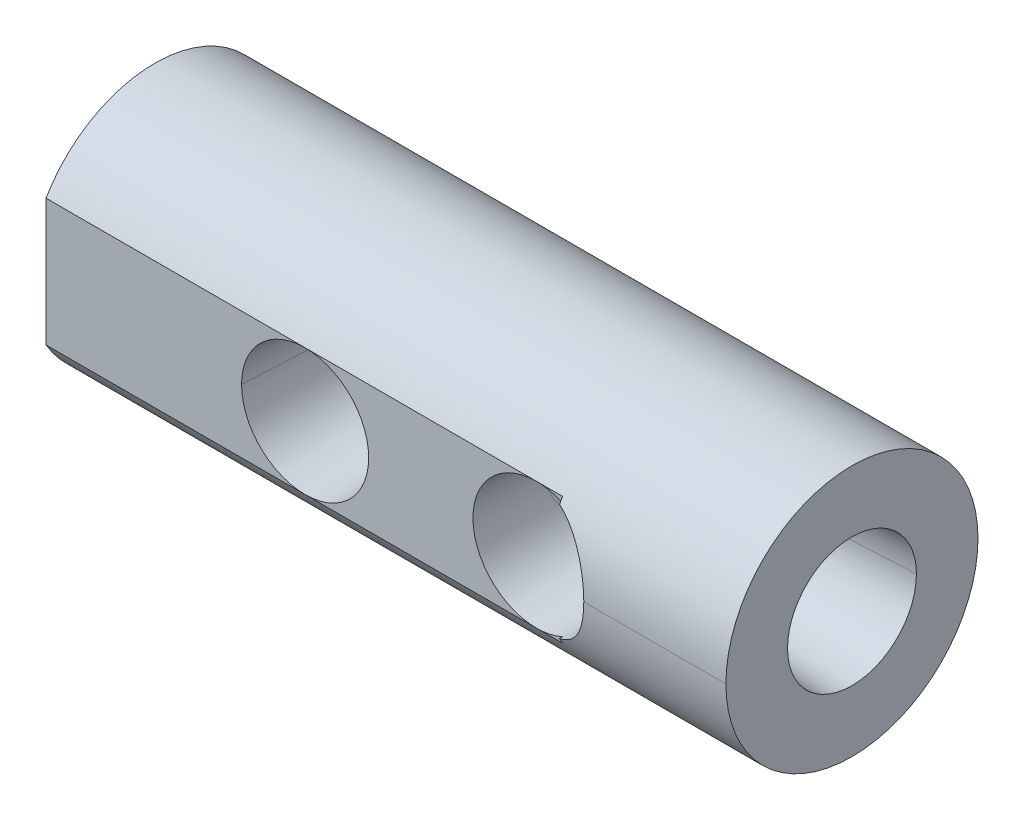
ISO-10303-21;
HEADER;
FILE_DESCRIPTION(('STEP AP214'),'2;1');
FILE_NAME('part.step','',(''),(''),'','','');
FILE_SCHEMA(('AUTOMOTIVE_DESIGN { 1 0 10303 214 1 1 1 1 }'));
ENDSEC;
DATA;
#1=APPLICATION_CONTEXT('core data for automotive mechanical design processes');
#2=APPLICATION_PROTOCOL_DEFINITION('international standard','automotive_design',2000,#1);
#3=PRODUCT_CONTEXT('',#1,'mechanical');
#4=PRODUCT('Part','Part','',(#3));
#5=PRODUCT_RELATED_PRODUCT_CATEGORY('part','',(#4));
#6=PRODUCT_DEFINITION_FORMATION('','',#4);
#7=PRODUCT_DEFINITION_CONTEXT('part definition',#1,'design');
#8=PRODUCT_DEFINITION('design','',#6,#7);
#9=PRODUCT_DEFINITION_SHAPE('','',#8);
#10=(LENGTH_UNIT() NAMED_UNIT(*) SI_UNIT(.MILLI.,.METRE.));
#11=(NAMED_UNIT(*) PLANE_ANGLE_UNIT() SI_UNIT($,.RADIAN.));
#12=(NAMED_UNIT(*) SI_UNIT($,.STERADIAN.) SOLID_ANGLE_UNIT());
#13=UNCERTAINTY_MEASURE_WITH_UNIT(LENGTH_MEASURE(1.E-05),#10,'distance_accuracy_value','');
#14=(GEOMETRIC_REPRESENTATION_CONTEXT(3) GLOBAL_UNCERTAINTY_ASSIGNED_CONTEXT((#13)) GLOBAL_UNIT_ASSIGNED_CONTEXT((#10,
#11,#12)) REPRESENTATION_CONTEXT('',''));
#15=CARTESIAN_POINT('',(0.,0.,0.));
#16=DIRECTION('',(0.,0.,1.));
#17=DIRECTION('',(1.,0.,0.));
#18=AXIS2_PLACEMENT_3D('',#15,#16,#17);
#19=CARTESIAN_POINT('',(46.6400387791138,0.,7.747));
#20=DIRECTION('',(1.,0.,0.));
#21=DIRECTION('',(0.,0.,1.));
#22=AXIS2_PLACEMENT_3D('',#19,#20,#21);
#23=CYLINDRICAL_SURFACE('',#22,1.3843);
#24=DIRECTION('',(-1.,0.,1.481257E-09));
#25=VECTOR('',#24,1.);
#26=CARTESIAN_POINT('',(22.7457,0.,9.1313));
#27=LINE('',#26,#25);
#28=CARTESIAN_POINT('',(20.2438,0.,9.13130000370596));
#29=VERTEX_POINT('',#28);
#30=CARTESIAN_POINT('',(19.5547450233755,0.,9.13130000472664));
#31=VERTEX_POINT('',#30);
#32=EDGE_CURVE('E334',#29,#31,#27,.T.);
#33=ORIENTED_EDGE('',*,*,#32,.F.);
#34=CARTESIAN_POINT('',(20.2438,0.,7.747));
#35=DIRECTION('',(1.,0.,0.));
#36=DIRECTION('',(0.,0.,-1.));
#37=AXIS2_PLACEMENT_3D('',#34,#35,#36);
#38=CIRCLE('',#37,1.3843000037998);
#39=CARTESIAN_POINT('',(20.2438,0.,6.36269999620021));
#40=VERTEX_POINT('',#39);
#41=EDGE_CURVE('E444',#29,#40,#38,.T.);
#42=ORIENTED_EDGE('',*,*,#41,.T.);
#43=DIRECTION('',(1.,0.,9.121833E-10));
#44=VECTOR('',#43,1.);
#45=CARTESIAN_POINT('',(18.5801000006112,0.,6.36269999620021));
#46=LINE('',#45,#44);
#47=CARTESIAN_POINT('',(18.5801000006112,0.,6.36269999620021));
#48=VERTEX_POINT('',#47);
#49=EDGE_CURVE('E269',#48,#40,#46,.T.);
#50=ORIENTED_EDGE('',*,*,#49,.F.);
#51=CARTESIAN_POINT('',(18.3496042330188,-1.08188794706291,8.6106));
#52=CARTESIAN_POINT('',(18.3451712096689,-1.09181945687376,8.59815815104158));
#53=CARTESIAN_POINT('',(18.3407507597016,-1.10155880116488,8.58551703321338));
#54=CARTESIAN_POINT('',(18.3319511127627,-1.1206497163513,8.55982643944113));
#55=CARTESIAN_POINT('',(18.3275764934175,-1.12999080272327,8.54678907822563));
#56=CARTESIAN_POINT('',(18.3146349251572,-1.15722961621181,8.50734681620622));
#57=CARTESIAN_POINT('',(18.3062189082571,-1.17441217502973,8.48052192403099));
#58=CARTESIAN_POINT('',(18.2817860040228,-1.22309321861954,8.39844223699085));
#59=CARTESIAN_POINT('',(18.2665798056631,-1.2517422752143,8.34159195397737));
#60=CARTESIAN_POINT('',(18.2461712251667,-1.28894761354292,8.25289375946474));
#61=CARTESIAN_POINT('',(18.2397694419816,-1.30038379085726,8.22275492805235));
#62=CARTESIAN_POINT('',(18.2308773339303,-1.31604065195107,8.17663596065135));
#63=CARTESIAN_POINT('',(18.2280318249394,-1.32100973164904,8.16111101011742));
#64=CARTESIAN_POINT('',(18.2225973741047,-1.33043598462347,8.12974630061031));
#65=CARTESIAN_POINT('',(18.220006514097,-1.33489630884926,8.11388860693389));
#66=CARTESIAN_POINT('',(18.2078582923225,-1.35568785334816,8.03457534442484));
#67=CARTESIAN_POINT('',(18.2006148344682,-1.36769965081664,7.97046416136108));
#68=CARTESIAN_POINT('',(18.1915592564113,-1.38264957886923,7.84090797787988));
#69=CARTESIAN_POINT('',(18.189747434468,-1.38558830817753,7.77546302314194));
#70=CARTESIAN_POINT('',(18.1911230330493,-1.3833366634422,7.6927798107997));
#71=CARTESIAN_POINT('',(18.1915804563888,-1.38258776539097,7.67618615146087));
#72=CARTESIAN_POINT('',(18.192861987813,-1.38048540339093,7.64296355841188));
#73=CARTESIAN_POINT('',(18.1936818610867,-1.37913886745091,7.62643635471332));
#74=CARTESIAN_POINT('',(18.1966610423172,-1.37423188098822,7.57710091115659));
#75=CARTESIAN_POINT('',(18.1993399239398,-1.36980529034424,7.54453858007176));
#76=CARTESIAN_POINT('',(18.2093125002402,-1.35316165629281,7.44779655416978));
#77=CARTESIAN_POINT('',(18.218542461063,-1.33759880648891,7.38455807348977));
#78=CARTESIAN_POINT('',(18.2328285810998,-1.31261599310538,7.30700993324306));
#79=CARTESIAN_POINT('',(18.2358232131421,-1.30734152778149,7.2915756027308));
#80=CARTESIAN_POINT('',(18.2420752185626,-1.29623231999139,7.26085699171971));
#81=CARTESIAN_POINT('',(18.2453254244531,-1.29041008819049,7.2456100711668));
#82=CARTESIAN_POINT('',(18.2553721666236,-1.27223960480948,7.20042233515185));
#83=CARTESIAN_POINT('',(18.2624830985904,-1.25915561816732,7.17094096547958));
#84=CARTESIAN_POINT('',(18.2848358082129,-1.21707340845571,7.08432332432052));
#85=CARTESIAN_POINT('',(18.3010937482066,-1.18526179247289,7.02900328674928));
#86=CARTESIAN_POINT('',(18.3224607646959,-1.14079928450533,6.96270517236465));
#87=CARTESIAN_POINT('',(18.3267867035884,-1.13167053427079,6.94958896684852));
#88=CARTESIAN_POINT('',(18.3355283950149,-1.11293504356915,6.92364215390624));
#89=CARTESIAN_POINT('',(18.3399512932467,-1.10331222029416,6.91079164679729));
#90=CARTESIAN_POINT('',(18.3532529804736,-1.07389191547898,6.87289145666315));
#91=CARTESIAN_POINT('',(18.3621777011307,-1.05351703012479,6.84844885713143));
#92=CARTESIAN_POINT('',(18.388937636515,-0.990133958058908,6.77749268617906));
#93=CARTESIAN_POINT('',(18.406757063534,-0.944880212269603,6.73333658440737));
#94=CARTESIAN_POINT('',(18.4327798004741,-0.872364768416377,6.67169882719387));
#95=CARTESIAN_POINT('',(18.441336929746,-0.847417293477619,6.65192257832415));
#96=CARTESIAN_POINT('',(18.453913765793,-0.808784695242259,6.62342986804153));
#97=CARTESIAN_POINT('',(18.458062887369,-0.795705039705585,6.61412780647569));
#98=CARTESIAN_POINT('',(18.4662605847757,-0.769130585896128,6.59592048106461));
#99=CARTESIAN_POINT('',(18.4702999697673,-0.755664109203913,6.58703587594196));
#100=CARTESIAN_POINT('',(18.4900619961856,-0.687798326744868,6.54393875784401));
#101=CARTESIAN_POINT('',(18.5045857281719,-0.631467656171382,6.5134471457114));
#102=CARTESIAN_POINT('',(18.5304167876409,-0.514644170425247,6.46031999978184));
#103=CARTESIAN_POINT('',(18.5417277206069,-0.454152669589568,6.43768323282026));
#104=CARTESIAN_POINT('',(18.5534206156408,-0.375725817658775,6.41456463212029));
#105=CARTESIAN_POINT('',(18.5556366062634,-0.359899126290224,6.41020121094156));
#106=CARTESIAN_POINT('',(18.5587673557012,-0.335940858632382,6.40405614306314));
#107=CARTESIAN_POINT('',(18.5597799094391,-0.327908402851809,6.40207217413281));
#108=CARTESIAN_POINT('',(18.5617319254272,-0.311828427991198,6.39825324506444));
#109=CARTESIAN_POINT('',(18.5626714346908,-0.303781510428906,6.39641818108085));
#110=CARTESIAN_POINT('',(18.567186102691,-0.263512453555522,6.38761222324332));
#111=CARTESIAN_POINT('',(18.570212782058,-0.231187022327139,6.38174794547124));
#112=CARTESIAN_POINT('',(18.5775192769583,-0.133884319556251,6.36763131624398));
#113=CARTESIAN_POINT('',(18.5800281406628,-0.068582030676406,6.36283778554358));
#114=CARTESIAN_POINT('',(18.5800994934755,-0.0018933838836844,6.36270097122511));
#115=CARTESIAN_POINT('',(18.5801000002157,-0.0009467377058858,6.36269999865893));
#116=CARTESIAN_POINT('',(18.5801000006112,0.,6.36269999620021));
#117=B_SPLINE_CURVE_WITH_KNOTS('',3,(#51,#52,#53,#54,#55,#56,#57,#58,#59,#60,#61,#62,#63,#64,
#65,#66,#67,#68,#69,#70,#71,#72,#73,#74,#75,#76,#77,#78,#79,#80,#81,#82,#83,#84,#85,#86,#87,#88,
#89,#90,#91,#92,#93,#94,#95,#96,#97,#98,#99,#100,#101,#102,#103,#104,#105,#106,#107,#108,#109,
#110,#111,#112,#113,#114,#115,#116),.UNSPECIFIED.,.F.,.F.,(4,2,2,2,2,2,2,2,2,2,2,2,2,2,2,2,2,2,
2,2,2,2,2,2,2,2,2,2,2,2,2,2,4),(0.,0.0078125,0.015624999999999,0.031249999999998,
0.062499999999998,0.078124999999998,0.085937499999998,0.093749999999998,0.124999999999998,
0.15625,0.1640625,0.171875,0.1875,0.21875,0.2265625,0.234375,0.25,0.28125,0.2890625,0.296875,
0.3125,0.34375,0.359375,0.3671875,0.375,0.40625,0.4375,0.4453125,0.449218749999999,0.453125,
0.46875,0.5,0.500449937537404),.UNSPECIFIED.);
#118=CARTESIAN_POINT('',(18.3496042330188,-1.08188794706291,8.6106));
#119=VERTEX_POINT('',#118);
#120=EDGE_CURVE('E333',#119,#48,#117,.T.);
#121=ORIENTED_EDGE('',*,*,#120,.F.);
#122=DIRECTION('',(-1.,0.,0.));
#123=VECTOR('',#122,1.);
#124=CARTESIAN_POINT('',(19.3611233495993,-1.08188794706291,8.6106));
#125=LINE('',#124,#123);
#126=CARTESIAN_POINT('',(19.3611233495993,-1.08188794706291,8.6106));
#127=VERTEX_POINT('',#126);
#128=EDGE_CURVE('E384',#127,#119,#125,.T.);
#129=ORIENTED_EDGE('',*,*,#128,.F.);
#130=CARTESIAN_POINT('',(19.5547450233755,0.,9.13130000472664));
#131=CARTESIAN_POINT('',(19.5547450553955,-0.0515913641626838,9.13130024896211));
#132=CARTESIAN_POINT('',(19.5534949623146,-0.103355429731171,9.12842558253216));
#133=CARTESIAN_POINT('',(19.549679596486,-0.181601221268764,9.1195917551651));
#134=CARTESIAN_POINT('',(19.5480801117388,-0.207693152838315,9.1158819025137));
#135=CARTESIAN_POINT('',(19.5442808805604,-0.259386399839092,9.10703411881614));
#136=CARTESIAN_POINT('',(19.5420804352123,-0.285001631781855,9.10189456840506));
#137=CARTESIAN_POINT('',(19.5346165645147,-0.361169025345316,9.08436993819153));
#138=CARTESIAN_POINT('',(19.5284913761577,-0.411044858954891,9.06988573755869));
#139=CARTESIAN_POINT('',(19.5177209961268,-0.484530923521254,9.04399297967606));
#140=CARTESIAN_POINT('',(19.5138668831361,-0.508804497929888,9.03466592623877));
#141=CARTESIAN_POINT('',(19.5056522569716,-0.556906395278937,9.01460436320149));
#142=CARTESIAN_POINT('',(19.501280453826,-0.580785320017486,9.00384127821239));
#143=CARTESIAN_POINT('',(19.4876065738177,-0.650917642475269,8.96982177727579));
#144=CARTESIAN_POINT('',(19.4777100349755,-0.695918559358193,8.94475279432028));
#145=CARTESIAN_POINT('',(19.456683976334,-0.782600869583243,8.8900005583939));
#146=CARTESIAN_POINT('',(19.4455535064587,-0.824281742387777,8.86031686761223));
#147=CARTESIAN_POINT('',(19.428162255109,-0.884350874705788,8.81230141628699));
#148=CARTESIAN_POINT('',(19.4222491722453,-0.903964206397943,8.79571308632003));
#149=CARTESIAN_POINT('',(19.4132345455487,-0.9327650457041,8.76993784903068));
#150=CARTESIAN_POINT('',(19.4102092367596,-0.942249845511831,8.76120769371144));
#151=CARTESIAN_POINT('',(19.4041401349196,-0.960937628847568,8.74351938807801));
#152=CARTESIAN_POINT('',(19.4010938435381,-0.970148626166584,8.73455411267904));
#153=CARTESIAN_POINT('',(19.3858175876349,-1.01554469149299,8.68912278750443));
#154=CARTESIAN_POINT('',(19.3734528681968,-1.0497600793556,8.6508486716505));
#155=CARTESIAN_POINT('',(19.3611233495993,-1.08188794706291,8.6106));
#156=B_SPLINE_CURVE_WITH_KNOTS('',3,(#130,#131,#132,#133,#134,#135,#136,#137,#138,#139,#140,
#141,#142,#143,#144,#145,#146,#147,#148,#149,#150,#151,#152,#153,#154,#155),.UNSPECIFIED.,.F.,
.F.,(4,2,2,2,2,2,2,2,2,2,2,2,4),(0.500786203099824,0.5625,0.59375,0.625,0.6875,0.71875,0.75,
0.8125,0.875,0.90625,0.921875,0.9375,1.),.UNSPECIFIED.);
#157=EDGE_CURVE('E357',#31,#127,#156,.T.);
#158=ORIENTED_EDGE('',*,*,#157,.F.);
#159=EDGE_LOOP('',(#33,#42,#50,#121,#129,#158));
#160=FACE_BOUND('',#159,.T.);
#161=ADVANCED_FACE('F16',(#160),#23,.F.);
#162=CARTESIAN_POINT('',(33.7514562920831,0.,8.6106));
#163=DIRECTION('',(0.,0.,1.));
#164=DIRECTION('',(1.,0.,0.));
#165=AXIS2_PLACEMENT_3D('',#162,#163,#164);
#166=PLANE('',#165);
#167=CARTESIAN_POINT('',(30.1498,0.,8.6106));
#168=DIRECTION('',(0.,0.,-1.));
#169=DIRECTION('',(-1.,0.,0.));
#170=AXIS2_PLACEMENT_3D('',#167,#168,#169);
#171=CIRCLE('',#170,3.6016562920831);
#172=CARTESIAN_POINT('',(27.3130093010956,2.21913194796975,8.6106));
#173=VERTEX_POINT('',#172);
#174=CARTESIAN_POINT('',(32.9865906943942,2.21913194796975,8.6106));
#175=VERTEX_POINT('',#174);
#176=EDGE_CURVE('E265',#173,#175,#171,.T.);
#177=ORIENTED_EDGE('',*,*,#176,.F.);
#178=CARTESIAN_POINT('',(30.1498,0.,8.6106));
#179=DIRECTION('',(0.,0.,1.));
#180=DIRECTION('',(1.,0.,0.));
#181=AXIS2_PLACEMENT_3D('',#178,#179,#180);
#182=CIRCLE('',#181,3.60165629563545);
#183=CARTESIAN_POINT('',(27.044939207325,1.82531299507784,8.6106));
#184=VERTEX_POINT('',#183);
#185=EDGE_CURVE('E249',#173,#184,#182,.T.);
#186=ORIENTED_EDGE('',*,*,#185,.T.);
#187=DIRECTION('',(1.,0.,0.));
#188=VECTOR('',#187,1.);
#189=CARTESIAN_POINT('',(35.9664,1.82531299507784,8.6106));
#190=LINE('',#189,#188);
#191=CARTESIAN_POINT('',(27.4955,1.82531299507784,8.6106));
#192=VERTEX_POINT('',#191);
#193=EDGE_CURVE('E10',#192,#184,#190,.F.);
#194=ORIENTED_EDGE('',*,*,#193,.F.);
#195=DIRECTION('',(0.,-1.,0.));
#196=VECTOR('',#195,1.);
#197=CARTESIAN_POINT('',(27.4955,0.,8.6106));
#198=LINE('',#197,#196);
#199=CARTESIAN_POINT('',(27.4955,2.21913194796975,8.6106));
#200=VERTEX_POINT('',#199);
#201=EDGE_CURVE('E447',#200,#192,#198,.T.);
#202=ORIENTED_EDGE('',*,*,#201,.F.);
#203=DIRECTION('',(-1.,0.,0.));
#204=VECTOR('',#203,1.);
#205=CARTESIAN_POINT('',(28.6935164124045,2.21913194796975,8.6106));
#206=LINE('',#205,#204);
#207=CARTESIAN_POINT('',(28.6935164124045,2.21913194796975,8.6106));
#208=VERTEX_POINT('',#207);
#209=EDGE_CURVE('E282',#200,#208,#206,.F.);
#210=ORIENTED_EDGE('',*,*,#209,.T.);
#211=CARTESIAN_POINT('',(30.1498,0.,8.6106));
#212=DIRECTION('',(0.,0.,-1.));
#213=DIRECTION('',(-1.,0.,0.));
#214=AXIS2_PLACEMENT_3D('',#211,#212,#213);
#215=CIRCLE('',#214,2.6543);
#216=CARTESIAN_POINT('',(31.6060835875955,2.21913194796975,8.6106));
#217=VERTEX_POINT('',#216);
#218=EDGE_CURVE('E289',#208,#217,#215,.T.);
#219=ORIENTED_EDGE('',*,*,#218,.T.);
#220=DIRECTION('',(-1.,0.,0.));
#221=VECTOR('',#220,1.);
#222=CARTESIAN_POINT('',(32.9865906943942,2.21913194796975,8.6106));
#223=LINE('',#222,#221);
#224=EDGE_CURVE('E274',#217,#175,#223,.F.);
#225=ORIENTED_EDGE('',*,*,#224,.T.);
#226=EDGE_LOOP('',(#177,#186,#194,#202,#210,#219,#225));
#227=FACE_BOUND('',#226,.T.);
#228=ADVANCED_FACE('F272',(#227),#166,.T.);
#229=CARTESIAN_POINT('',(33.7514562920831,0.,8.6106));
#230=DIRECTION('',(0.,0.,1.));
#231=DIRECTION('',(1.,0.,0.));
#232=AXIS2_PLACEMENT_3D('',#229,#230,#231);
#233=PLANE('',#232);
#234=DIRECTION('',(-1.,0.,0.));
#235=VECTOR('',#234,1.);
#236=CARTESIAN_POINT('',(28.6935164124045,-2.21913194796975,8.6106));
#237=LINE('',#236,#235);
#238=CARTESIAN_POINT('',(28.6935164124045,-2.21913194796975,8.6106));
#239=VERTEX_POINT('',#238);
#240=CARTESIAN_POINT('',(27.4955,-2.21913194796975,8.6106));
#241=VERTEX_POINT('',#240);
#242=EDGE_CURVE('E297',#239,#241,#237,.T.);
#243=ORIENTED_EDGE('',*,*,#242,.T.);
#244=CARTESIAN_POINT('',(27.4955,-1.82531299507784,8.6106));
#245=VERTEX_POINT('',#244);
#246=EDGE_CURVE('E258',#245,#241,#198,.T.);
#247=ORIENTED_EDGE('',*,*,#246,.F.);
#248=DIRECTION('',(1.,0.,0.));
#249=VECTOR('',#248,1.);
#250=CARTESIAN_POINT('',(35.9664,-1.82531299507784,8.6106));
#251=LINE('',#250,#249);
#252=CARTESIAN_POINT('',(27.044939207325,-1.82531299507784,8.6106));
#253=VERTEX_POINT('',#252);
#254=EDGE_CURVE('E24',#253,#245,#251,.T.);
#255=ORIENTED_EDGE('',*,*,#254,.F.);
#256=CARTESIAN_POINT('',(27.3130093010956,-2.21913194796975,8.6106));
#257=VERTEX_POINT('',#256);
#258=EDGE_CURVE('E259',#253,#257,#182,.T.);
#259=ORIENTED_EDGE('',*,*,#258,.T.);
#260=CARTESIAN_POINT('',(30.1498,0.,8.6106));
#261=DIRECTION('',(0.,0.,-1.));
#262=DIRECTION('',(-1.,0.,0.));
#263=AXIS2_PLACEMENT_3D('',#260,#261,#262);
#264=CIRCLE('',#263,3.6016562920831);
#265=CARTESIAN_POINT('',(32.9865906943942,-2.21913194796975,8.6106));
#266=VERTEX_POINT('',#265);
#267=EDGE_CURVE('E268',#266,#257,#264,.T.);
#268=ORIENTED_EDGE('',*,*,#267,.F.);
#269=DIRECTION('',(-1.,0.,0.));
#270=VECTOR('',#269,1.);
#271=CARTESIAN_POINT('',(32.9865906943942,-2.21913194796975,8.6106));
#272=LINE('',#271,#270);
#273=CARTESIAN_POINT('',(31.6060835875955,-2.21913194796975,8.6106));
#274=VERTEX_POINT('',#273);
#275=EDGE_CURVE('E296',#266,#274,#272,.T.);
#276=ORIENTED_EDGE('',*,*,#275,.T.);
#277=CARTESIAN_POINT('',(30.1498,0.,8.6106));
#278=DIRECTION('',(0.,0.,-1.));
#279=DIRECTION('',(-1.,0.,0.));
#280=AXIS2_PLACEMENT_3D('',#277,#278,#279);
#281=CIRCLE('',#280,2.6543);
#282=EDGE_CURVE('E300',#274,#239,#281,.T.);
#283=ORIENTED_EDGE('',*,*,#282,.T.);
#284=EDGE_LOOP('',(#243,#247,#255,#259,#268,#276,#283));
#285=FACE_BOUND('',#284,.T.);
#286=ADVANCED_FACE('F420',(#285),#233,.T.);
#287=CARTESIAN_POINT('',(30.1498,0.,15.494));
#288=DIRECTION('',(0.,0.,1.));
#289=DIRECTION('',(1.,0.,0.));
#290=AXIS2_PLACEMENT_3D('',#287,#288,#289);
#291=CONICAL_SURFACE('',#290,3.9624,0.0523598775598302);
#292=CARTESIAN_POINT('',(32.9865906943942,2.21913194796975,8.6106));
#293=CARTESIAN_POINT('',(33.0071777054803,2.19753522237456,8.66609558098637));
#294=CARTESIAN_POINT('',(33.0286101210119,2.17413330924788,8.72008722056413));
#295=CARTESIAN_POINT('',(33.0727069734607,2.12387840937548,8.82537604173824));
#296=CARTESIAN_POINT('',(33.0953722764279,2.09702472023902,8.87667238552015));
#297=CARTESIAN_POINT('',(33.141552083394,2.03992555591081,8.97678701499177));
#298=CARTESIAN_POINT('',(33.1650672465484,2.00967977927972,9.02560480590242));
#299=CARTESIAN_POINT('',(33.2126151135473,1.94577271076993,9.12090378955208));
#300=CARTESIAN_POINT('',(33.2366483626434,1.91211142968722,9.16738473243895));
#301=CARTESIAN_POINT('',(33.2728627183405,1.85898088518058,9.23541172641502));
#302=CARTESIAN_POINT('',(33.2849617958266,1.84083031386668,9.25780450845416));
#303=CARTESIAN_POINT('',(33.3031252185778,1.81292842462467,9.29097241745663));
#304=CARTESIAN_POINT('',(33.309182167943,1.80351508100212,9.30195814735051));
#305=CARTESIAN_POINT('',(33.3212966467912,1.7844598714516,9.32378928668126));
#306=CARTESIAN_POINT('',(33.3273597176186,1.77480896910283,9.3346444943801));
#307=CARTESIAN_POINT('',(33.3575687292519,1.72613178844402,9.38839766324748));
#308=CARTESIAN_POINT('',(33.3814282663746,1.68579088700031,9.42979284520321));
#309=CARTESIAN_POINT('',(33.4282836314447,1.6022855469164,9.50948792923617));
#310=CARTESIAN_POINT('',(33.4512799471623,1.55912111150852,9.54778753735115));
#311=CARTESIAN_POINT('',(33.4961732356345,1.4698884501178,9.62133250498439));
#312=CARTESIAN_POINT('',(33.5180706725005,1.42382042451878,9.65657783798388));
#313=CARTESIAN_POINT('',(33.5605281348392,1.32864264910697,9.72398275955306));
#314=CARTESIAN_POINT('',(33.581088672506,1.27953333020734,9.75614258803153));
#315=CARTESIAN_POINT('',(33.6107352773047,1.20343438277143,9.80198764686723));
#316=CARTESIAN_POINT('',(33.6204182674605,1.17766167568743,9.8168696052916));
#317=CARTESIAN_POINT('',(33.6346177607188,1.1383680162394,9.8385768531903));
#318=CARTESIAN_POINT('',(33.6392967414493,1.1251643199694,9.84570994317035));
#319=CARTESIAN_POINT('',(33.6485417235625,1.09854058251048,9.85976755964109));
#320=CARTESIAN_POINT('',(33.6531029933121,1.08513350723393,9.86668485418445));
#321=CARTESIAN_POINT('',(33.675515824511,1.01785420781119,9.90059168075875));
#322=CARTESIAN_POINT('',(33.692262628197,0.963036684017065,9.92565978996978));
#323=CARTESIAN_POINT('',(33.7232236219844,0.851371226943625,9.97167192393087));
#324=CARTESIAN_POINT('',(33.7374381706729,0.794523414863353,9.99261605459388));
#325=CARTESIAN_POINT('',(33.7631453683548,0.678720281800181,10.0302866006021));
#326=CARTESIAN_POINT('',(33.7746384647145,0.619765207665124,10.0470134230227));
#327=CARTESIAN_POINT('',(33.7896676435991,0.529663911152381,10.0688015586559));
#328=CARTESIAN_POINT('',(33.7943086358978,0.49935169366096,10.0755131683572));
#329=CARTESIAN_POINT('',(33.8006923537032,0.453451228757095,10.084729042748));
#330=CARTESIAN_POINT('',(33.8027259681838,0.438061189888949,10.0876619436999));
#331=CARTESIAN_POINT('',(33.8065770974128,0.407292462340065,10.0932115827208));
#332=CARTESIAN_POINT('',(33.8083968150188,0.39189971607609,10.0958315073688));
#333=CARTESIAN_POINT('',(33.8169671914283,0.314894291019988,10.1081619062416));
#334=CARTESIAN_POINT('',(33.8221344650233,0.253156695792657,10.115568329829));
#335=CARTESIAN_POINT('',(33.8290970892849,0.12941790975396,10.125540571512));
#336=CARTESIAN_POINT('',(33.830892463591,0.067416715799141,10.1281062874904));
#337=CARTESIAN_POINT('',(33.8309915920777,0.0035221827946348,10.1282480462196));
#338=CARTESIAN_POINT('',(33.8309929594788,0.0017611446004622,10.1282500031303));
#339=CARTESIAN_POINT('',(33.8309929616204,0.,10.1282500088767));
#340=B_SPLINE_CURVE_WITH_KNOTS('',3,(#292,#293,#294,#295,#296,#297,#298,#299,#300,#301,#302,
#303,#304,#305,#306,#307,#308,#309,#310,#311,#312,#313,#314,#315,#316,#317,#318,#319,#320,#321,
#322,#323,#324,#325,#326,#327,#328,#329,#330,#331,#332,#333,#334,#335,#336,#337,#338,#339),
.UNSPECIFIED.,.F.,.F.,(4,2,2,2,2,2,2,2,2,2,2,2,2,2,2,2,2,2,2,2,2,2,2,4),(0.,0.03125,0.0625,
0.093749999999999,0.125,0.140625,0.1484375,0.15625,0.1875,0.21875,0.250000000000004,
0.281250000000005,0.296875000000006,0.304687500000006,0.312500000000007,0.343750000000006,
0.375000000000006,0.406250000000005,0.421875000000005,0.429687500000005,0.437500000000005,
0.46875,0.500000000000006,0.50088565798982),.UNSPECIFIED.);
#341=CARTESIAN_POINT('',(33.8309929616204,0.,10.1282500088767));
#342=VERTEX_POINT('',#341);
#343=EDGE_CURVE('E277',#175,#342,#340,.T.);
#344=ORIENTED_EDGE('',*,*,#343,.T.);
#345=CARTESIAN_POINT('',(33.8309929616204,0.,10.1282500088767));
#346=CARTESIAN_POINT('',(33.8309930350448,-0.0603799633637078,10.1282502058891));
#347=CARTESIAN_POINT('',(33.8293883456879,-0.120884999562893,10.1259569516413));
#348=CARTESIAN_POINT('',(33.8244857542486,-0.212718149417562,10.1189362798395));
#349=CARTESIAN_POINT('',(33.8223861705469,-0.243970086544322,10.1159280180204));
#350=CARTESIAN_POINT('',(33.8173170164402,-0.306470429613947,10.1086556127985));
#351=CARTESIAN_POINT('',(33.8143663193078,-0.337492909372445,10.1044185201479));
#352=CARTESIAN_POINT('',(33.8043090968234,-0.429897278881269,10.0899527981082));
#353=CARTESIAN_POINT('',(33.7959987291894,-0.490617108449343,10.0779727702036));
#354=CARTESIAN_POINT('',(33.7763615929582,-0.610370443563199,10.0495175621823));
#355=CARTESIAN_POINT('',(33.7650344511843,-0.669403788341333,10.0330420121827));
#356=CARTESIAN_POINT('',(33.7395207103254,-0.785833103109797,9.99567868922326));
#357=CARTESIAN_POINT('',(33.7253338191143,-0.843229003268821,9.9747908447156));
#358=CARTESIAN_POINT('',(33.702006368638,-0.928111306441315,9.94014725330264));
#359=CARTESIAN_POINT('',(33.6939342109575,-0.956038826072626,9.92811349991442));
#360=CARTESIAN_POINT('',(33.6772504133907,-1.01112790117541,9.90312771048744));
#361=CARTESIAN_POINT('',(33.6686359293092,-1.03829972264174,9.89017146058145));
#362=CARTESIAN_POINT('',(33.642024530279,-1.11873478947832,9.84994523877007));
#363=CARTESIAN_POINT('',(33.6232604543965,-1.17091943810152,9.8213203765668));
#364=CARTESIAN_POINT('',(33.5839270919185,-1.27256458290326,9.7605631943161));
#365=CARTESIAN_POINT('',(33.5633573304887,-1.32202479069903,9.72843068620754));
#366=CARTESIAN_POINT('',(33.5313141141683,-1.394245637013,9.67762089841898));
#367=CARTESIAN_POINT('',(33.5204348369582,-1.41799061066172,9.66024852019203));
#368=CARTESIAN_POINT('',(33.4983067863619,-1.46483102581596,9.62462811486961));
#369=CARTESIAN_POINT('',(33.4870460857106,-1.4879481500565,9.6063600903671));
#370=CARTESIAN_POINT('',(33.4529825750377,-1.55588126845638,9.5506123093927));
#371=CARTESIAN_POINT('',(33.4298316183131,-1.59942932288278,9.51208451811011));
#372=CARTESIAN_POINT('',(33.3829077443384,-1.68324549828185,9.43234332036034));
#373=CARTESIAN_POINT('',(33.359134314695,-1.72351323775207,9.39112984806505));
#374=CARTESIAN_POINT('',(33.3112264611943,-1.80089422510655,9.30598711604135));
#375=CARTESIAN_POINT('',(33.2870915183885,-1.83800735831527,9.26205804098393));
#376=CARTESIAN_POINT('',(33.2387369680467,-1.9091372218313,9.17138301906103));
#377=CARTESIAN_POINT('',(33.2145167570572,-1.94315409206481,9.12463753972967));
#378=CARTESIAN_POINT('',(33.1783541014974,-1.99184987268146,9.05227047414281));
#379=CARTESIAN_POINT('',(33.1663626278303,-2.00764617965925,9.02784083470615));
#380=CARTESIAN_POINT('',(33.1425956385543,-2.03831231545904,8.97845415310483));
#381=CARTESIAN_POINT('',(33.1308122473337,-2.05319274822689,8.95348142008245));
#382=CARTESIAN_POINT('',(33.0958272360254,-2.09648536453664,8.87770152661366));
#383=CARTESIAN_POINT('',(33.0729890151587,-2.12355172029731,8.82603492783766));
#384=CARTESIAN_POINT('',(33.028664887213,-2.17407611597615,8.72023241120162));
#385=CARTESIAN_POINT('',(33.00717825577,-2.19753464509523,8.66609706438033));
#386=CARTESIAN_POINT('',(32.9865906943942,-2.21913194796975,8.6106));
#387=B_SPLINE_CURVE_WITH_KNOTS('',3,(#345,#346,#347,#348,#349,#350,#351,#352,#353,#354,#355,
#356,#357,#358,#359,#360,#361,#362,#363,#364,#365,#366,#367,#368,#369,#370,#371,#372,#373,#374,
#375,#376,#377,#378,#379,#380,#381,#382,#383,#384,#385,#386),.UNSPECIFIED.,.F.,.F.,(4,2,2,2,2,2,
2,2,2,2,2,2,2,2,2,2,2,2,2,2,4),(0.50088565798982,0.531250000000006,0.546875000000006,0.5625,
0.59375,0.625,0.65625,0.671875,0.6875,0.71875,0.75,0.765625,0.78125,0.8125,0.84375,0.875,
0.90625,0.921875,0.9375,0.96875,1.),.UNSPECIFIED.);
#388=EDGE_CURVE('E302',#342,#266,#387,.T.);
#389=ORIENTED_EDGE('',*,*,#388,.T.);
#390=ORIENTED_EDGE('',*,*,#267,.T.);
#391=CARTESIAN_POINT('',(27.3130834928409,2.21920976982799,8.6104));
#392=CARTESIAN_POINT('',(27.2881445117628,2.19305455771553,8.67759486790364));
#393=CARTESIAN_POINT('',(27.2617933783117,2.16406303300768,8.74311171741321));
#394=CARTESIAN_POINT('',(27.2071736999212,2.10070096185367,8.8706039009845));
#395=CARTESIAN_POINT('',(27.1789062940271,2.0663335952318,8.93258129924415));
#396=CARTESIAN_POINT('',(27.1212089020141,1.99232731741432,9.05314057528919));
#397=CARTESIAN_POINT('',(27.0917745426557,1.95266693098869,9.11170714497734));
#398=CARTESIAN_POINT('',(27.0326389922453,1.86838401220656,9.22499859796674));
#399=CARTESIAN_POINT('',(27.0029377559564,1.82376062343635,9.2797228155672));
#400=CARTESIAN_POINT('',(26.9146110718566,1.68280180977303,9.43768937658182));
#401=CARTESIAN_POINT('',(26.8566284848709,1.57921266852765,9.5349939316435));
#402=CARTESIAN_POINT('',(26.7479638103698,1.35413733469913,9.7109208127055));
#403=CARTESIAN_POINT('',(26.6972675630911,1.23268680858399,9.78957957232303));
#404=CARTESIAN_POINT('',(26.6177931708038,1.00183610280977,9.91028505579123));
#405=CARTESIAN_POINT('',(26.5866460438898,0.895468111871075,9.95656798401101));
#406=CARTESIAN_POINT('',(26.5343080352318,0.675007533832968,10.0335428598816));
#407=CARTESIAN_POINT('',(26.5130976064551,0.560930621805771,10.06426542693));
#408=CARTESIAN_POINT('',(26.4881517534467,0.371664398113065,10.1002394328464));
#409=CARTESIAN_POINT('',(26.4808472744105,0.297894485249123,10.1107200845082));
#410=CARTESIAN_POINT('',(26.4710696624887,0.149362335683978,10.1247319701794));
#411=CARTESIAN_POINT('',(26.4685975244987,0.0745998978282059,10.1282617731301));
#412=CARTESIAN_POINT('',(26.4686220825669,-0.118294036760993,10.1282313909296));
#413=CARTESIAN_POINT('',(26.4748229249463,-0.236481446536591,10.1193850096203));
#414=CARTESIAN_POINT('',(26.4990473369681,-0.469109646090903,10.0845563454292));
#415=CARTESIAN_POINT('',(26.5170860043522,-0.583545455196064,10.0585521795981));
#416=CARTESIAN_POINT('',(26.563278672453,-0.804917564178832,9.99105721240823));
#417=CARTESIAN_POINT('',(26.5913848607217,-0.911886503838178,9.94963957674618));
#418=CARTESIAN_POINT('',(26.6555905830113,-1.11682260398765,9.85315905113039));
#419=CARTESIAN_POINT('',(26.6916920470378,-1.21478758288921,9.79809286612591));
#420=CARTESIAN_POINT('',(26.7729401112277,-1.40855234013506,9.67077665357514));
#421=CARTESIAN_POINT('',(26.8186000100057,-1.50342485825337,9.59744946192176));
#422=CARTESIAN_POINT('',(26.9135452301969,-1.68020802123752,9.43856803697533));
#423=CARTESIAN_POINT('',(26.9628324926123,-1.7621116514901,9.35300723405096));
#424=CARTESIAN_POINT('',(27.064974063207,-1.91704131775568,9.16511143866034));
#425=CARTESIAN_POINT('',(27.1178581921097,-1.98918822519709,9.06206090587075));
#426=CARTESIAN_POINT('',(27.1942221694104,-2.08500679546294,8.89898585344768));
#427=CARTESIAN_POINT('',(27.2191807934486,-2.11487700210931,8.84321692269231));
#428=CARTESIAN_POINT('',(27.2674955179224,-2.17031903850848,8.72888344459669));
#429=CARTESIAN_POINT('',(27.2908508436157,-2.19588879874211,8.67031756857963));
#430=CARTESIAN_POINT('',(27.3130834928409,-2.21920976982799,8.6104));
#431=B_SPLINE_CURVE_WITH_KNOTS('',3,(#391,#392,#393,#394,#395,#396,#397,#398,#399,#400,#401,
#402,#403,#404,#405,#406,#407,#408,#409,#410,#411,#412,#413,#414,#415,#416,#417,#418,#419,#420,
#421,#422,#423,#424,#425,#426,#427,#428,#429,#430),.UNSPECIFIED.,.F.,.F.,(4,2,2,2,2,2,2,2,2,2,2,
2,2,2,2,2,2,2,2,4),(0.,0.228742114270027,0.45734943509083,0.68691419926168,0.916518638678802,
1.37471243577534,1.83200340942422,2.19087487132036,2.54903738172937,2.77319515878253,
2.99739908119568,3.35137210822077,3.70579746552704,4.05856143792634,4.41141065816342,
4.79490980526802,5.17861567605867,5.5863902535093,5.7902370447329,5.99418165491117),.UNSPECIFIED.);
#432=EDGE_CURVE('E252',#173,#257,#431,.T.);
#433=ORIENTED_EDGE('',*,*,#432,.F.);
#434=ORIENTED_EDGE('',*,*,#176,.T.);
#435=EDGE_LOOP('',(#344,#389,#390,#433,#434));
#436=FACE_BOUND('',#435,.T.);
#437=DIRECTION('',(-0.052335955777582,0.,-0.998629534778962));
#438=VECTOR('',#437,1.);
#439=CARTESIAN_POINT('',(34.1122000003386,0.,15.4940000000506));
#440=LINE('',#439,#438);
#441=CARTESIAN_POINT('',(34.1122000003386,0.,15.4940000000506));
#442=VERTEX_POINT('',#441);
#443=CARTESIAN_POINT('',(34.0361981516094,0.,14.0437983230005));
#444=VERTEX_POINT('',#443);
#445=EDGE_CURVE('E30',#442,#444,#440,.T.);
#446=ORIENTED_EDGE('',*,*,#445,.T.);
#447=ORIENTED_EDGE('',*,*,#445,.F.);
#448=CARTESIAN_POINT('',(31.75,3.5747791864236,14.6199151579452));
#449=CARTESIAN_POINT('',(31.8365857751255,3.5371442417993,14.6394900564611));
#450=CARTESIAN_POINT('',(31.9218072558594,3.49645472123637,14.660263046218));
#451=CARTESIAN_POINT('',(32.0476192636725,3.43077370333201,14.6929627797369));
#452=CARTESIAN_POINT('',(32.0892802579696,3.40806775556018,14.7041370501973));
#453=CARTESIAN_POINT('',(32.1713780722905,3.36140563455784,14.7268018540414));
#454=CARTESIAN_POINT('',(32.2118685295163,3.33742435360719,14.7383052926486));
#455=CARTESIAN_POINT('',(32.3317084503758,3.26355332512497,14.7732505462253));
#456=CARTESIAN_POINT('',(32.4094291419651,3.21173946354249,14.7971263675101));
#457=CARTESIAN_POINT('',(32.5606906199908,3.10302638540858,14.8456463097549));
#458=CARTESIAN_POINT('',(32.6342311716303,3.04612704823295,14.8702908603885));
#459=CARTESIAN_POINT('',(32.7772138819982,2.92719315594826,14.9199842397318));
#460=CARTESIAN_POINT('',(32.8466560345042,2.86515876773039,14.9450334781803));
#461=CARTESIAN_POINT('',(32.9477471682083,2.76814532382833,14.9826467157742));
#462=CARTESIAN_POINT('',(32.9809315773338,2.73514642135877,14.9951910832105));
#463=CARTESIAN_POINT('',(33.0299336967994,2.6846351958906,15.0139846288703));
#464=CARTESIAN_POINT('',(33.0461491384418,2.66761797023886,15.0202494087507));
#465=CARTESIAN_POINT('',(33.0782722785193,2.6332930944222,15.0327470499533));
#466=CARTESIAN_POINT('',(33.0941582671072,2.6160090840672,15.0389713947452));
#467=CARTESIAN_POINT('',(33.172718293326,2.52898286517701,15.0699581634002));
#468=CARTESIAN_POINT('',(33.2327868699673,2.45742477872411,15.0943150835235));
#469=CARTESIAN_POINT('',(33.3474991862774,2.31043507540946,15.1418539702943));
#470=CARTESIAN_POINT('',(33.4021426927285,2.23500342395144,15.1650363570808));
#471=CARTESIAN_POINT('',(33.5060336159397,2.08020126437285,15.2099261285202));
#472=CARTESIAN_POINT('',(33.5552810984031,2.00083091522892,15.2316339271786));
#473=CARTESIAN_POINT('',(33.6483069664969,1.83801861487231,15.2732711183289));
#474=CARTESIAN_POINT('',(33.6920857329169,1.75457704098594,15.293200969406));
#475=CARTESIAN_POINT('',(33.7535160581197,1.62620492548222,15.3215222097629));
#476=CARTESIAN_POINT('',(33.7732856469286,1.58287863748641,15.3307001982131));
#477=CARTESIAN_POINT('',(33.8018535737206,1.5170600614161,15.3440414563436));
#478=CARTESIAN_POINT('',(33.8111993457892,1.49497050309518,15.3484196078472));
#479=CARTESIAN_POINT('',(33.8294389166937,1.45072106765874,15.3569885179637));
#480=CARTESIAN_POINT('',(33.8383436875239,1.42853660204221,15.3611843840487));
#481=CARTESIAN_POINT('',(33.8817989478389,1.31731638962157,15.3817149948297));
#482=CARTESIAN_POINT('',(33.9131482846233,1.22738808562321,15.3967037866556));
#483=CARTESIAN_POINT('',(33.9691075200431,1.04563131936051,15.4236597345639));
#484=CARTESIAN_POINT('',(33.9937172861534,0.953802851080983,15.4356271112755));
#485=CARTESIAN_POINT('',(34.036172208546,0.768222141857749,15.4563813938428));
#486=CARTESIAN_POINT('',(34.054017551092,0.674469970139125,15.4651685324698));
#487=CARTESIAN_POINT('',(34.0828030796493,0.484989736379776,15.4793877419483));
#488=CARTESIAN_POINT('',(34.0937438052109,0.389261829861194,15.4848200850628));
#489=CARTESIAN_POINT('',(34.1029373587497,0.268314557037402,15.4893899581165));
#490=CARTESIAN_POINT('',(34.1045516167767,0.244060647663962,15.4901928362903));
#491=CARTESIAN_POINT('',(34.1073256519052,0.195422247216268,15.4915730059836));
#492=CARTESIAN_POINT('',(34.1084829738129,0.171071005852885,15.4921490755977));
#493=CARTESIAN_POINT('',(34.1112571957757,0.0981839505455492,15.4935302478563));
#494=CARTESIAN_POINT('',(34.1121827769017,0.0497113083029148,15.4939914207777));
#495=CARTESIAN_POINT('',(34.1121999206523,0.000903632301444,15.493999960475));
#496=CARTESIAN_POINT('',(34.1122000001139,0.000451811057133,15.494000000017));
#497=CARTESIAN_POINT('',(34.1122000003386,0.,15.4940000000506));
#498=B_SPLINE_CURVE_WITH_KNOTS('',3,(#448,#449,#450,#451,#452,#453,#454,#455,#456,#457,#458,
#459,#460,#461,#462,#463,#464,#465,#466,#467,#468,#469,#470,#471,#472,#473,#474,#475,#476,#477,
#478,#479,#480,#481,#482,#483,#484,#485,#486,#487,#488,#489,#490,#491,#492,#493,#494,#495,#496,
#497),.UNSPECIFIED.,.F.,.F.,(4,2,2,2,2,2,2,2,2,2,2,2,2,2,2,2,2,2,2,2,2,2,2,2,4),(0.,
0.031249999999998,0.046874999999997,0.062499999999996,0.093749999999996,0.124999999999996,
0.156249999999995,0.171874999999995,0.179687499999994,0.187499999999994,0.218749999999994,
0.249999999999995,0.281249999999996,0.3125,0.328125,0.3359375,0.34375,0.375,0.40625,0.4375,
0.46875,0.4765625,0.484375,0.5,0.500145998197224),.UNSPECIFIED.);
#499=CARTESIAN_POINT('',(31.75,3.5747791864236,14.6199151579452));
#500=VERTEX_POINT('',#499);
#501=EDGE_CURVE('E280',#500,#442,#498,.T.);
#502=ORIENTED_EDGE('',*,*,#501,.F.);
#503=CARTESIAN_POINT('',(31.75,3.5747791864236,14.6199151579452));
#504=CARTESIAN_POINT('',(31.75,3.57127162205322,14.5588278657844));
#505=CARTESIAN_POINT('',(31.75,3.56776319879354,14.4977406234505));
#506=CARTESIAN_POINT('',(31.75,3.56425390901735,14.436653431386));
#507=B_SPLINE_CURVE_WITH_KNOTS('',3,(#503,#504,#505,#506),.UNSPECIFIED.,.F.,.F.,(4,4),(0.,1.),.UNSPECIFIED.);
#508=CARTESIAN_POINT('',(31.75,3.56425390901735,14.436653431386));
#509=VERTEX_POINT('',#508);
#510=EDGE_CURVE('E276',#500,#509,#507,.T.);
#511=ORIENTED_EDGE('',*,*,#510,.T.);
#512=CARTESIAN_POINT('',(30.1498,0.,14.436653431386));
#513=DIRECTION('',(0.,0.,-1.));
#514=DIRECTION('',(0.,1.,0.));
#515=AXIS2_PLACEMENT_3D('',#512,#513,#514);
#516=CIRCLE('',#515,3.9069868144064);
#517=CARTESIAN_POINT('',(30.1498,3.9069868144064,14.436653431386));
#518=VERTEX_POINT('',#517);
#519=EDGE_CURVE('E659',#518,#509,#516,.T.);
#520=ORIENTED_EDGE('',*,*,#519,.F.);
#521=CARTESIAN_POINT('',(30.1498,0.,14.436653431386));
#522=DIRECTION('',(0.,0.,-1.));
#523=DIRECTION('',(0.,1.,0.));
#524=AXIS2_PLACEMENT_3D('',#521,#522,#523);
#525=CIRCLE('',#524,3.9069868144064);
#526=CARTESIAN_POINT('',(26.2428131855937,0.,14.436653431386));
#527=VERTEX_POINT('',#526);
#528=EDGE_CURVE('E307',#527,#518,#525,.T.);
#529=ORIENTED_EDGE('',*,*,#528,.F.);
#530=DIRECTION('',(-0.05233595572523,0.,0.998629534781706));
#531=VECTOR('',#530,1.);
#532=CARTESIAN_POINT('',(26.4714197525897,0.,10.0745802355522));
#533=LINE('',#532,#531);
#534=CARTESIAN_POINT('',(26.2634018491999,0.,14.0437983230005));
#535=VERTEX_POINT('',#534);
#536=EDGE_CURVE('E35',#535,#527,#533,.T.);
#537=ORIENTED_EDGE('',*,*,#536,.F.);
#538=ORIENTED_EDGE('',*,*,#536,.T.);
#539=CARTESIAN_POINT('',(30.1498,0.,14.436653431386));
#540=DIRECTION('',(0.,0.,-1.));
#541=DIRECTION('',(0.,1.,0.));
#542=AXIS2_PLACEMENT_3D('',#539,#540,#541);
#543=CIRCLE('',#542,3.9069868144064);
#544=CARTESIAN_POINT('',(30.1498,-3.9069868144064,14.436653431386));
#545=VERTEX_POINT('',#544);
#546=EDGE_CURVE('E303',#545,#527,#543,.T.);
#547=ORIENTED_EDGE('',*,*,#546,.F.);
#548=CARTESIAN_POINT('',(30.1498,0.,14.436653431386));
#549=DIRECTION('',(0.,0.,-1.));
#550=DIRECTION('',(0.,1.,0.));
#551=AXIS2_PLACEMENT_3D('',#548,#549,#550);
#552=CIRCLE('',#551,3.9069868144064);
#553=CARTESIAN_POINT('',(31.75,-3.56425390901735,14.436653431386));
#554=VERTEX_POINT('',#553);
#555=EDGE_CURVE('E618',#554,#545,#552,.T.);
#556=ORIENTED_EDGE('',*,*,#555,.F.);
#557=CARTESIAN_POINT('',(31.75,-3.56425390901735,14.436653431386));
#558=CARTESIAN_POINT('',(31.75,-3.56776319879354,14.4977406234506));
#559=CARTESIAN_POINT('',(31.75,-3.57127162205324,14.5588278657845));
#560=CARTESIAN_POINT('',(31.75,-3.5747791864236,14.6199151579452));
#561=B_SPLINE_CURVE_WITH_KNOTS('',3,(#557,#558,#559,#560),.UNSPECIFIED.,.F.,.F.,(4,4),(0.,1.),.UNSPECIFIED.);
#562=CARTESIAN_POINT('',(31.75,-3.5747791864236,14.6199151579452));
#563=VERTEX_POINT('',#562);
#564=EDGE_CURVE('E310',#554,#563,#561,.T.);
#565=ORIENTED_EDGE('',*,*,#564,.T.);
#566=CARTESIAN_POINT('',(34.1122000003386,0.,15.4940000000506));
#567=CARTESIAN_POINT('',(34.1122000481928,-0.0962555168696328,15.4940000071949));
#568=CARTESIAN_POINT('',(34.1086037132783,-0.192048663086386,15.4922068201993));
#569=CARTESIAN_POINT('',(34.0943308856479,-0.383177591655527,15.4851116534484));
#570=CARTESIAN_POINT('',(34.083621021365,-0.478509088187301,15.4797931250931));
#571=CARTESIAN_POINT('',(34.0551159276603,-0.668265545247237,15.4657098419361));
#572=CARTESIAN_POINT('',(34.037320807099,-0.76269051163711,15.456944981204));
#573=CARTESIAN_POINT('',(34.0105922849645,-0.880151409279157,15.4438760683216));
#574=CARTESIAN_POINT('',(34.0050220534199,-0.903615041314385,15.4411566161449));
#575=CARTESIAN_POINT('',(33.9934299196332,-0.950484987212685,15.435507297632));
#576=CARTESIAN_POINT('',(33.9874039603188,-0.973906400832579,15.4325754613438));
#577=CARTESIAN_POINT('',(33.9686707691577,-1.04398418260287,15.42347871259));
#578=CARTESIAN_POINT('',(33.9553587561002,-1.0902711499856,15.4170370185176));
#579=CARTESIAN_POINT('',(33.9130090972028,-1.22787285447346,15.3966364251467));
#580=CARTESIAN_POINT('',(33.881561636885,-1.31793018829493,15.3816027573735));
#581=CARTESIAN_POINT('',(33.8124384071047,-1.49483263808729,15.3489454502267));
#582=CARTESIAN_POINT('',(33.7747622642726,-1.58167751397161,15.331321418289));
#583=CARTESIAN_POINT('',(33.6932634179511,-1.75224178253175,15.2937399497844));
#584=CARTESIAN_POINT('',(33.6494406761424,-1.8359610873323,15.2737821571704));
#585=CARTESIAN_POINT('',(33.5790746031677,-1.95922373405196,15.2422818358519));
#586=CARTESIAN_POINT('',(33.554846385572,-1.99992485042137,15.2315210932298));
#587=CARTESIAN_POINT('',(33.5173340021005,-2.06039691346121,15.2150124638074));
#588=CARTESIAN_POINT('',(33.5046577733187,-2.08042022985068,15.2094584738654));
#589=CARTESIAN_POINT('',(33.4790005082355,-2.12014478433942,15.1982697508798));
#590=CARTESIAN_POINT('',(33.4660137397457,-2.13985528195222,15.1926324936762));
#591=CARTESIAN_POINT('',(33.4002959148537,-2.23765932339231,15.1642452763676));
#592=CARTESIAN_POINT('',(33.3452169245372,-2.31351118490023,15.1408930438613));
#593=CARTESIAN_POINT('',(33.2301549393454,-2.46063897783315,15.0932401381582));
#594=CARTESIAN_POINT('',(33.1701717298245,-2.5319145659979,15.0689390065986));
#595=CARTESIAN_POINT('',(33.0453082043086,-2.67000903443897,15.0197184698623));
#596=CARTESIAN_POINT('',(32.9804279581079,-2.73682782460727,14.9947986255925));
#597=CARTESIAN_POINT('',(32.8793683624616,-2.83374291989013,14.9572087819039));
#598=CARTESIAN_POINT('',(32.8450578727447,-2.86549515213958,14.9446439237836));
#599=CARTESIAN_POINT('',(32.7926408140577,-2.91229233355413,14.9257774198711));
#600=CARTESIAN_POINT('',(32.7750098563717,-2.92775282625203,14.9194853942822));
#601=CARTESIAN_POINT('',(32.7394275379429,-2.95839585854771,14.9069006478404));
#602=CARTESIAN_POINT('',(32.7214597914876,-2.9735917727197,14.9006022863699));
#603=CARTESIAN_POINT('',(32.631091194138,-3.0486431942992,14.8692200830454));
#604=CARTESIAN_POINT('',(32.557022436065,-3.10579768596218,14.844434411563));
#605=CARTESIAN_POINT('',(32.4053527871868,-3.21452716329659,14.7958559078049));
#606=CARTESIAN_POINT('',(32.3277518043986,-3.26610182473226,14.7720627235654));
#607=CARTESIAN_POINT('',(32.168966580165,-3.36375528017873,14.7258306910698));
#608=CARTESIAN_POINT('',(32.0877824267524,-3.4098340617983,14.7033914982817));
#609=CARTESIAN_POINT('',(31.9217135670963,-3.49647550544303,14.6602488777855));
#610=CARTESIAN_POINT('',(31.8368291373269,-3.53703846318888,14.6395450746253));
#611=CARTESIAN_POINT('',(31.75,-3.5747791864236,14.6199151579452));
#612=B_SPLINE_CURVE_WITH_KNOTS('',3,(#566,#567,#568,#569,#570,#571,#572,#573,#574,#575,#576,
#577,#578,#579,#580,#581,#582,#583,#584,#585,#586,#587,#588,#589,#590,#591,#592,#593,#594,#595,
#596,#597,#598,#599,#600,#601,#602,#603,#604,#605,#606,#607,#608,#609,#610,#611),.UNSPECIFIED.,
.F.,.F.,(4,2,2,2,2,2,2,2,2,2,2,2,2,2,2,2,2,2,2,2,2,2,4),(0.500145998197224,0.53125,0.5625,
0.59375,0.6015625,0.609375,0.625,0.65625,0.6875,0.71875,0.734375,0.7421875,0.75,0.78125,0.8125,
0.84375,0.859375,0.8671875,0.875,0.90625,0.9375,0.96875,1.),.UNSPECIFIED.);
#613=EDGE_CURVE('E613',#442,#563,#612,.T.);
#614=ORIENTED_EDGE('',*,*,#613,.F.);
#615=EDGE_LOOP('',(#446,#447,#502,#511,#520,#529,#537,#538,#547,#556,#565,#614));
#616=FACE_BOUND('',#615,.T.);
#617=ADVANCED_FACE('F264',(#436,#616),#291,.F.);
#618=CARTESIAN_POINT('',(3.175,-2.74229830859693,7.747));
#619=DIRECTION('',(-1.,0.,0.));
#620=DIRECTION('',(0.,0.,1.));
#621=AXIS2_PLACEMENT_3D('',#618,#619,#620);
#622=PLANE('',#621);
#623=DIRECTION('',(0.,0.500000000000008,-0.866025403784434));
#624=VECTOR('',#623,1.);
#625=CARTESIAN_POINT('',(3.175,-2.74229830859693,7.747));
#626=LINE('',#625,#624);
#627=CARTESIAN_POINT('',(3.175,-2.74229830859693,7.747));
#628=VERTEX_POINT('',#627);
#629=CARTESIAN_POINT('',(3.175,-1.37114915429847,5.3721));
#630=VERTEX_POINT('',#629);
#631=EDGE_CURVE('E463',#628,#630,#626,.T.);
#632=ORIENTED_EDGE('',*,*,#631,.F.);
#633=DIRECTION('',(0.,-0.500000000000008,-0.866025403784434));
#634=VECTOR('',#633,1.);
#635=CARTESIAN_POINT('',(3.175,-1.37114915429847,10.1219));
#636=LINE('',#635,#634);
#637=CARTESIAN_POINT('',(3.175,-1.37114915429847,10.1219));
#638=VERTEX_POINT('',#637);
#639=EDGE_CURVE('E1075',#638,#628,#636,.T.);
#640=ORIENTED_EDGE('',*,*,#639,.F.);
#641=DIRECTION('',(0.,-1.,0.));
#642=VECTOR('',#641,1.);
#643=CARTESIAN_POINT('',(3.175,1.37114915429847,10.1219));
#644=LINE('',#643,#642);
#645=CARTESIAN_POINT('',(3.175,1.37114915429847,10.1219));
#646=VERTEX_POINT('',#645);
#647=EDGE_CURVE('E1093',#646,#638,#644,.T.);
#648=ORIENTED_EDGE('',*,*,#647,.F.);
#649=DIRECTION('',(0.,-0.500000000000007,0.866025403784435));
#650=VECTOR('',#649,1.);
#651=CARTESIAN_POINT('',(3.175,2.74229830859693,7.747));
#652=LINE('',#651,#650);
#653=CARTESIAN_POINT('',(3.175,2.74229830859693,7.747));
#654=VERTEX_POINT('',#653);
#655=EDGE_CURVE('E1099',#654,#646,#652,.T.);
#656=ORIENTED_EDGE('',*,*,#655,.F.);
#657=DIRECTION('',(0.,0.500000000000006,0.866025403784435));
#658=VECTOR('',#657,1.);
#659=CARTESIAN_POINT('',(3.175,1.37114915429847,5.3721));
#660=LINE('',#659,#658);
#661=CARTESIAN_POINT('',(3.175,1.37114915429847,5.3721));
#662=VERTEX_POINT('',#661);
#663=EDGE_CURVE('E1100',#662,#654,#660,.T.);
#664=ORIENTED_EDGE('',*,*,#663,.F.);
#665=DIRECTION('',(0.,1.,0.));
#666=VECTOR('',#665,1.);
#667=CARTESIAN_POINT('',(3.175,-1.37114915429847,5.3721));
#668=LINE('',#667,#666);
#669=EDGE_CURVE('E1108',#630,#662,#668,.T.);
#670=ORIENTED_EDGE('',*,*,#669,.F.);
#671=EDGE_LOOP('',(#632,#640,#648,#656,#664,#670));
#672=FACE_BOUND('',#671,.T.);
#673=ADVANCED_FACE('F470',(#672),#622,.T.);
#674=CARTESIAN_POINT('',(42.8498,0.,7.747));
#675=DIRECTION('',(1.,0.,0.));
#676=DIRECTION('',(0.,0.,-1.));
#677=AXIS2_PLACEMENT_3D('',#674,#675,#676);
#678=CONICAL_SURFACE('',#677,3.9624,0.0523598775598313);
#679=DIRECTION('',(0.998629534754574,0.,-0.052335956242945));
#680=VECTOR('',#679,1.);
#681=CARTESIAN_POINT('',(35.9664,0.,4.14534370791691));
#682=LINE('',#681,#680);
#683=CARTESIAN_POINT('',(35.9664,0.,4.14534370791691));
#684=VERTEX_POINT('',#683);
#685=CARTESIAN_POINT('',(42.8498,0.,3.7846));
#686=VERTEX_POINT('',#685);
#687=EDGE_CURVE('E401',#684,#686,#682,.T.);
#688=ORIENTED_EDGE('',*,*,#687,.T.);
#689=CARTESIAN_POINT('',(42.8498,0.,7.747));
#690=DIRECTION('',(-1.,0.,0.));
#691=DIRECTION('',(0.,0.,1.));
#692=AXIS2_PLACEMENT_3D('',#689,#690,#691);
#693=CIRCLE('',#692,3.9624);
#694=CARTESIAN_POINT('',(42.8498,0.,11.7094));
#695=VERTEX_POINT('',#694);
#696=EDGE_CURVE('E662',#695,#686,#693,.T.);
#697=ORIENTED_EDGE('',*,*,#696,.F.);
#698=DIRECTION('',(-0.998629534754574,0.,-0.052335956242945));
#699=VECTOR('',#698,1.);
#700=CARTESIAN_POINT('',(42.8498,0.,11.7094));
#701=LINE('',#700,#699);
#702=CARTESIAN_POINT('',(35.9664,0.,11.3486562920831));
#703=VERTEX_POINT('',#702);
#704=EDGE_CURVE('E1125',#695,#703,#701,.T.);
#705=ORIENTED_EDGE('',*,*,#704,.T.);
#706=CARTESIAN_POINT('',(35.9664,0.,7.747));
#707=DIRECTION('',(-1.,0.,0.));
#708=DIRECTION('',(0.,0.,1.));
#709=AXIS2_PLACEMENT_3D('',#706,#707,#708);
#710=CIRCLE('',#709,3.6016562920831);
#711=EDGE_CURVE('E1128',#703,#684,#710,.T.);
#712=ORIENTED_EDGE('',*,*,#711,.T.);
#713=EDGE_LOOP('',(#688,#697,#705,#712));
#714=FACE_BOUND('',#713,.T.);
#715=ADVANCED_FACE('F473',(#714),#678,.F.);
#716=CARTESIAN_POINT('',(42.8498,0.,7.747));
#717=DIRECTION('',(1.,0.,0.));
#718=DIRECTION('',(0.,0.,-1.));
#719=AXIS2_PLACEMENT_3D('',#716,#717,#718);
#720=CONICAL_SURFACE('',#719,3.9624,0.0523598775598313);
#721=ORIENTED_EDGE('',*,*,#687,.F.);
#722=CARTESIAN_POINT('',(35.9664,0.,7.747));
#723=DIRECTION('',(-1.,0.,0.));
#724=DIRECTION('',(0.,0.,1.));
#725=AXIS2_PLACEMENT_3D('',#722,#723,#724);
#726=CIRCLE('',#725,3.6016562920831);
#727=EDGE_CURVE('E1078',#684,#703,#726,.T.);
#728=ORIENTED_EDGE('',*,*,#727,.T.);
#729=ORIENTED_EDGE('',*,*,#704,.F.);
#730=CARTESIAN_POINT('',(42.8498,0.,7.747));
#731=DIRECTION('',(-1.,0.,0.));
#732=DIRECTION('',(0.,0.,1.));
#733=AXIS2_PLACEMENT_3D('',#730,#731,#732);
#734=CIRCLE('',#733,3.9624);
#735=EDGE_CURVE('E665',#686,#695,#734,.T.);
#736=ORIENTED_EDGE('',*,*,#735,.F.);
#737=EDGE_LOOP('',(#721,#728,#729,#736));
#738=FACE_BOUND('',#737,.T.);
#739=ADVANCED_FACE('F477',(#738),#720,.F.);
#740=CARTESIAN_POINT('',(30.1498,0.,4.32646081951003));
#741=DIRECTION('',(0.,0.,1.));
#742=DIRECTION('',(1.,0.,0.));
#743=AXIS2_PLACEMENT_3D('',#740,#741,#742);
#744=CONICAL_SURFACE('',#743,2.6543,1.0471975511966);
#745=DIRECTION('',(0.866025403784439,0.,-0.5));
#746=VECTOR('',#745,1.);
#747=CARTESIAN_POINT('',(27.4955,0.,4.32646081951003));
#748=LINE('',#747,#746);
#749=CARTESIAN_POINT('',(27.4955,0.,4.32646081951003));
#750=VERTEX_POINT('',#749);
#751=CARTESIAN_POINT('',(30.1498,0.,2.794));
#752=VERTEX_POINT('',#751);
#753=EDGE_CURVE('E1080',#750,#752,#748,.T.);
#754=ORIENTED_EDGE('',*,*,#753,.T.);
#755=DIRECTION('',(0.866025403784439,0.,0.5));
#756=VECTOR('',#755,1.);
#757=CARTESIAN_POINT('',(30.1498,0.,2.794));
#758=LINE('',#757,#756);
#759=CARTESIAN_POINT('',(32.8041,0.,4.32646081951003));
#760=VERTEX_POINT('',#759);
#761=EDGE_CURVE('E1082',#752,#760,#758,.T.);
#762=ORIENTED_EDGE('',*,*,#761,.T.);
#763=CARTESIAN_POINT('',(30.1498,0.,4.32646081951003));
#764=DIRECTION('',(0.,0.,-1.));
#765=DIRECTION('',(-1.,0.,0.));
#766=AXIS2_PLACEMENT_3D('',#763,#764,#765);
#767=CIRCLE('',#766,2.6543);
#768=EDGE_CURVE('E704',#750,#760,#767,.T.);
#769=ORIENTED_EDGE('',*,*,#768,.F.);
#770=EDGE_LOOP('',(#754,#762,#769));
#771=FACE_BOUND('',#770,.T.);
#772=ADVANCED_FACE('F481',(#771),#744,.F.);
#773=CARTESIAN_POINT('',(30.1498,0.,4.32646081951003));
#774=DIRECTION('',(0.,0.,1.));
#775=DIRECTION('',(1.,0.,0.));
#776=AXIS2_PLACEMENT_3D('',#773,#774,#775);
#777=CONICAL_SURFACE('',#776,2.6543,1.0471975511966);
#778=ORIENTED_EDGE('',*,*,#753,.F.);
#779=CARTESIAN_POINT('',(30.1498,0.,4.32646081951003));
#780=DIRECTION('',(0.,0.,-1.));
#781=DIRECTION('',(-1.,0.,0.));
#782=AXIS2_PLACEMENT_3D('',#779,#780,#781);
#783=CIRCLE('',#782,2.6543);
#784=EDGE_CURVE('E725',#760,#750,#783,.T.);
#785=ORIENTED_EDGE('',*,*,#784,.F.);
#786=ORIENTED_EDGE('',*,*,#761,.F.);
#787=EDGE_LOOP('',(#778,#785,#786));
#788=FACE_BOUND('',#787,.T.);
#789=ADVANCED_FACE('F485',(#788),#777,.F.);
#790=CARTESIAN_POINT('',(35.9664,0.,4.14534370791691));
#791=DIRECTION('',(1.,0.,0.));
#792=DIRECTION('',(0.,0.,-1.));
#793=AXIS2_PLACEMENT_3D('',#790,#791,#792);
#794=PLANE('',#793);
#795=ORIENTED_EDGE('',*,*,#727,.F.);
#796=ORIENTED_EDGE('',*,*,#711,.F.);
#797=EDGE_LOOP('',(#795,#796));
#798=FACE_BOUND('',#797,.T.);
#799=CARTESIAN_POINT('',(35.9664,0.,7.747));
#800=DIRECTION('',(1.,0.,0.));
#801=DIRECTION('',(0.,0.,-1.));
#802=AXIS2_PLACEMENT_3D('',#799,#800,#801);
#803=CIRCLE('',#802,2.38125);
#804=CARTESIAN_POINT('',(35.9664,0.,10.12825));
#805=VERTEX_POINT('',#804);
#806=CARTESIAN_POINT('',(35.9664,0.,5.36575));
#807=VERTEX_POINT('',#806);
#808=EDGE_CURVE('E1085',#805,#807,#803,.F.);
#809=ORIENTED_EDGE('',*,*,#808,.T.);
#810=CARTESIAN_POINT('',(35.9664,0.,7.747));
#811=DIRECTION('',(1.,0.,0.));
#812=DIRECTION('',(0.,0.,-1.));
#813=AXIS2_PLACEMENT_3D('',#810,#811,#812);
#814=CIRCLE('',#813,2.38125);
#815=EDGE_CURVE('E1091',#807,#805,#814,.F.);
#816=ORIENTED_EDGE('',*,*,#815,.T.);
#817=EDGE_LOOP('',(#809,#816));
#818=FACE_BOUND('',#817,.T.);
#819=ADVANCED_FACE('F489',(#798,#818),#794,.T.);
#820=CARTESIAN_POINT('',(3.175,1.37114915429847,10.1219));
#821=DIRECTION('',(0.,0.,-1.));
#822=DIRECTION('',(-1.,0.,0.));
#823=AXIS2_PLACEMENT_3D('',#820,#821,#822);
#824=PLANE('',#823);
#825=DIRECTION('',(0.,-1.,0.));
#826=VECTOR('',#825,1.);
#827=CARTESIAN_POINT('',(0.,1.37114915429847,10.1219));
#828=LINE('',#827,#826);
#829=CARTESIAN_POINT('',(0.,1.37114915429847,10.1219));
#830=VERTEX_POINT('',#829);
#831=CARTESIAN_POINT('',(0.,-1.37114915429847,10.1219));
#832=VERTEX_POINT('',#831);
#833=EDGE_CURVE('E611',#830,#832,#828,.T.);
#834=ORIENTED_EDGE('',*,*,#833,.F.);
#835=DIRECTION('',(-1.,0.,0.));
#836=VECTOR('',#835,1.);
#837=CARTESIAN_POINT('',(3.175,1.37114915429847,10.1219));
#838=LINE('',#837,#836);
#839=EDGE_CURVE('E1096',#646,#830,#838,.T.);
#840=ORIENTED_EDGE('',*,*,#839,.F.);
#841=ORIENTED_EDGE('',*,*,#647,.T.);
#842=DIRECTION('',(-1.,0.,0.));
#843=VECTOR('',#842,1.);
#844=CARTESIAN_POINT('',(3.175,-1.37114915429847,10.1219));
#845=LINE('',#844,#843);
#846=EDGE_CURVE('E1101',#638,#832,#845,.T.);
#847=ORIENTED_EDGE('',*,*,#846,.T.);
#848=EDGE_LOOP('',(#834,#840,#841,#847));
#849=FACE_BOUND('',#848,.T.);
#850=ADVANCED_FACE('F493',(#849),#824,.T.);
#851=CARTESIAN_POINT('',(3.175,2.74229830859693,7.747));
#852=DIRECTION('',(0.,-0.866025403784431,-0.500000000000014));
#853=DIRECTION('',(0.,0.500000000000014,-0.866025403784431));
#854=AXIS2_PLACEMENT_3D('',#851,#852,#853);
#855=PLANE('',#854);
#856=DIRECTION('',(0.,-0.500000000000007,0.866025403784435));
#857=VECTOR('',#856,1.);
#858=CARTESIAN_POINT('',(0.,2.74229830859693,7.747));
#859=LINE('',#858,#857);
#860=CARTESIAN_POINT('',(0.,2.74229830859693,7.747));
#861=VERTEX_POINT('',#860);
#862=EDGE_CURVE('E1095',#861,#830,#859,.T.);
#863=ORIENTED_EDGE('',*,*,#862,.F.);
#864=DIRECTION('',(-1.,0.,0.));
#865=VECTOR('',#864,1.);
#866=CARTESIAN_POINT('',(3.175,2.74229830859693,7.747));
#867=LINE('',#866,#865);
#868=EDGE_CURVE('E1105',#654,#861,#867,.T.);
#869=ORIENTED_EDGE('',*,*,#868,.F.);
#870=ORIENTED_EDGE('',*,*,#655,.T.);
#871=ORIENTED_EDGE('',*,*,#839,.T.);
#872=EDGE_LOOP('',(#863,#869,#870,#871));
#873=FACE_BOUND('',#872,.T.);
#874=ADVANCED_FACE('F497',(#873),#855,.T.);
#875=CARTESIAN_POINT('',(3.175,1.37114915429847,5.3721));
#876=DIRECTION('',(0.,-0.866025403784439,0.5));
#877=DIRECTION('',(0.,-0.5,-0.866025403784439));
#878=AXIS2_PLACEMENT_3D('',#875,#876,#877);
#879=PLANE('',#878);
#880=DIRECTION('',(0.,0.500000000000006,0.866025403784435));
#881=VECTOR('',#880,1.);
#882=CARTESIAN_POINT('',(0.,1.37114915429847,5.3721));
#883=LINE('',#882,#881);
#884=CARTESIAN_POINT('',(0.,1.37114915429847,5.3721));
#885=VERTEX_POINT('',#884);
#886=EDGE_CURVE('E1104',#885,#861,#883,.T.);
#887=ORIENTED_EDGE('',*,*,#886,.F.);
#888=DIRECTION('',(-1.,0.,0.));
#889=VECTOR('',#888,1.);
#890=CARTESIAN_POINT('',(3.175,1.37114915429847,5.3721));
#891=LINE('',#890,#889);
#892=EDGE_CURVE('E1111',#662,#885,#891,.T.);
#893=ORIENTED_EDGE('',*,*,#892,.F.);
#894=ORIENTED_EDGE('',*,*,#663,.T.);
#895=ORIENTED_EDGE('',*,*,#868,.T.);
#896=EDGE_LOOP('',(#887,#893,#894,#895));
#897=FACE_BOUND('',#896,.T.);
#898=ADVANCED_FACE('F501',(#897),#879,.T.);
#899=CARTESIAN_POINT('',(3.175,-1.37114915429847,5.3721));
#900=DIRECTION('',(0.,0.,1.));
#901=DIRECTION('',(1.,0.,0.));
#902=AXIS2_PLACEMENT_3D('',#899,#900,#901);
#903=PLANE('',#902);
#904=DIRECTION('',(0.,1.,0.));
#905=VECTOR('',#904,1.);
#906=CARTESIAN_POINT('',(0.,-1.37114915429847,5.3721));
#907=LINE('',#906,#905);
#908=CARTESIAN_POINT('',(0.,-1.37114915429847,5.3721));
#909=VERTEX_POINT('',#908);
#910=EDGE_CURVE('E1063',#909,#885,#907,.T.);
#911=ORIENTED_EDGE('',*,*,#910,.F.);
#912=DIRECTION('',(-1.,0.,0.));
#913=VECTOR('',#912,1.);
#914=CARTESIAN_POINT('',(3.175,-1.37114915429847,5.3721));
#915=LINE('',#914,#913);
#916=EDGE_CURVE('E1115',#630,#909,#915,.T.);
#917=ORIENTED_EDGE('',*,*,#916,.F.);
#918=ORIENTED_EDGE('',*,*,#669,.T.);
#919=ORIENTED_EDGE('',*,*,#892,.T.);
#920=EDGE_LOOP('',(#911,#917,#918,#919));
#921=FACE_BOUND('',#920,.T.);
#922=ADVANCED_FACE('F505',(#921),#903,.T.);
#923=CARTESIAN_POINT('',(3.175,-2.74229830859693,7.747));
#924=DIRECTION('',(0.,0.866025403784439,0.5));
#925=DIRECTION('',(0.,-0.5,0.866025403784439));
#926=AXIS2_PLACEMENT_3D('',#923,#924,#925);
#927=PLANE('',#926);
#928=DIRECTION('',(0.,0.500000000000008,-0.866025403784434));
#929=VECTOR('',#928,1.);
#930=CARTESIAN_POINT('',(0.,-2.74229830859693,7.747));
#931=LINE('',#930,#929);
#932=CARTESIAN_POINT('',(0.,-2.74229830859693,7.747));
#933=VERTEX_POINT('',#932);
#934=EDGE_CURVE('E1057',#933,#909,#931,.T.);
#935=ORIENTED_EDGE('',*,*,#934,.F.);
#936=DIRECTION('',(-1.,0.,0.));
#937=VECTOR('',#936,1.);
#938=CARTESIAN_POINT('',(3.175,-2.74229830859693,7.747));
#939=LINE('',#938,#937);
#940=EDGE_CURVE('E1067',#628,#933,#939,.T.);
#941=ORIENTED_EDGE('',*,*,#940,.F.);
#942=ORIENTED_EDGE('',*,*,#631,.T.);
#943=ORIENTED_EDGE('',*,*,#916,.T.);
#944=EDGE_LOOP('',(#935,#941,#942,#943));
#945=FACE_BOUND('',#944,.T.);
#946=ADVANCED_FACE('F509',(#945),#927,.T.);
#947=CARTESIAN_POINT('',(3.175,-1.37114915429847,10.1219));
#948=DIRECTION('',(0.,0.866025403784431,-0.500000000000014));
#949=DIRECTION('',(0.,0.500000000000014,0.866025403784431));
#950=AXIS2_PLACEMENT_3D('',#947,#948,#949);
#951=PLANE('',#950);
#952=DIRECTION('',(0.,-0.500000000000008,-0.866025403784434));
#953=VECTOR('',#952,1.);
#954=CARTESIAN_POINT('',(0.,-1.37114915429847,10.1219));
#955=LINE('',#954,#953);
#956=EDGE_CURVE('E633',#832,#933,#955,.T.);
#957=ORIENTED_EDGE('',*,*,#956,.F.);
#958=ORIENTED_EDGE('',*,*,#846,.F.);
#959=ORIENTED_EDGE('',*,*,#639,.T.);
#960=ORIENTED_EDGE('',*,*,#940,.T.);
#961=EDGE_LOOP('',(#957,#958,#959,#960));
#962=FACE_BOUND('',#961,.T.);
#963=ADVANCED_FACE('F513',(#962),#951,.T.);
#964=CARTESIAN_POINT('',(42.8498,0.,7.747));
#965=DIRECTION('',(-1.,0.,0.));
#966=DIRECTION('',(0.,0.,1.));
#967=AXIS2_PLACEMENT_3D('',#964,#965,#966);
#968=PLANE('',#967);
#969=CARTESIAN_POINT('',(42.8498,0.,7.747));
#970=DIRECTION('',(-1.,0.,0.));
#971=DIRECTION('',(0.,1.,0.));
#972=AXIS2_PLACEMENT_3D('',#969,#970,#971);
#973=CIRCLE('',#972,7.747);
#974=CARTESIAN_POINT('',(42.8498,-7.747,7.747));
#975=VERTEX_POINT('',#974);
#976=CARTESIAN_POINT('',(42.8498,0.,15.494));
#977=VERTEX_POINT('',#976);
#978=EDGE_CURVE('E641',#975,#977,#973,.T.);
#979=ORIENTED_EDGE('',*,*,#978,.F.);
#980=CARTESIAN_POINT('',(42.8498,0.,7.747));
#981=DIRECTION('',(-1.,0.,0.));
#982=DIRECTION('',(0.,1.,0.));
#983=AXIS2_PLACEMENT_3D('',#980,#981,#982);
#984=CIRCLE('',#983,7.747);
#985=CARTESIAN_POINT('',(42.8498,0.,0.));
#986=VERTEX_POINT('',#985);
#987=EDGE_CURVE('E629',#986,#975,#984,.T.);
#988=ORIENTED_EDGE('',*,*,#987,.F.);
#989=CARTESIAN_POINT('',(42.8498,0.,7.747));
#990=DIRECTION('',(-1.,0.,0.));
#991=DIRECTION('',(0.,1.,0.));
#992=AXIS2_PLACEMENT_3D('',#989,#990,#991);
#993=CIRCLE('',#992,7.747);
#994=EDGE_CURVE('E612',#977,#986,#993,.T.);
#995=ORIENTED_EDGE('',*,*,#994,.F.);
#996=EDGE_LOOP('',(#979,#988,#995));
#997=FACE_BOUND('',#996,.T.);
#998=ORIENTED_EDGE('',*,*,#735,.T.);
#999=ORIENTED_EDGE('',*,*,#696,.T.);
#1000=EDGE_LOOP('',(#998,#999));
#1001=FACE_BOUND('',#1000,.T.);
#1002=ADVANCED_FACE('F517',(#997,#1001),#968,.F.);
#1003=CARTESIAN_POINT('',(31.75,3.9069868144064,14.436653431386));
#1004=DIRECTION('',(0.,0.,-1.));
#1005=DIRECTION('',(-1.,0.,0.));
#1006=AXIS2_PLACEMENT_3D('',#1003,#1004,#1005);
#1007=PLANE('',#1006);
#1008=ORIENTED_EDGE('',*,*,#519,.T.);
#1009=DIRECTION('',(0.,-1.,0.));
#1010=VECTOR('',#1009,1.);
#1011=CARTESIAN_POINT('',(31.75,3.9069868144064,14.436653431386));
#1012=LINE('',#1011,#1010);
#1013=CARTESIAN_POINT('',(31.75,3.9069868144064,14.436653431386));
#1014=VERTEX_POINT('',#1013);
#1015=EDGE_CURVE('E667',#1014,#509,#1012,.T.);
#1016=ORIENTED_EDGE('',*,*,#1015,.F.);
#1017=DIRECTION('',(-1.,0.,0.));
#1018=VECTOR('',#1017,1.);
#1019=CARTESIAN_POINT('',(31.75,3.9069868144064,14.436653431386));
#1020=LINE('',#1019,#1018);
#1021=EDGE_CURVE('E663',#1014,#518,#1020,.T.);
#1022=ORIENTED_EDGE('',*,*,#1021,.T.);
#1023=EDGE_LOOP('',(#1008,#1016,#1022));
#1024=FACE_BOUND('',#1023,.T.);
#1025=ADVANCED_FACE('F521',(#1024),#1007,.F.);
#1026=CARTESIAN_POINT('',(31.75,0.,14.436653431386));
#1027=DIRECTION('',(-1.,0.,0.));
#1028=DIRECTION('',(0.,0.,1.));
#1029=AXIS2_PLACEMENT_3D('',#1026,#1027,#1028);
#1030=PLANE('',#1029);
#1031=CARTESIAN_POINT('',(31.75,0.,7.747));
#1032=DIRECTION('',(-1.,0.,0.));
#1033=DIRECTION('',(0.,-1.,0.));
#1034=AXIS2_PLACEMENT_3D('',#1031,#1032,#1033);
#1035=CIRCLE('',#1034,7.747);
#1036=EDGE_CURVE('E636',#1014,#500,#1035,.F.);
#1037=ORIENTED_EDGE('',*,*,#1036,.F.);
#1038=ORIENTED_EDGE('',*,*,#1015,.T.);
#1039=ORIENTED_EDGE('',*,*,#510,.F.);
#1040=EDGE_LOOP('',(#1037,#1038,#1039));
#1041=FACE_BOUND('',#1040,.T.);
#1042=ADVANCED_FACE('F525',(#1041),#1030,.T.);
#1043=CARTESIAN_POINT('',(46.6400387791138,0.,7.747));
#1044=DIRECTION('',(1.,0.,0.));
#1045=DIRECTION('',(0.,0.,1.));
#1046=AXIS2_PLACEMENT_3D('',#1043,#1044,#1045);
#1047=CYLINDRICAL_SURFACE('',#1046,2.38125);
#1048=DIRECTION('',(-1.,0.,4.156935E-09));
#1049=VECTOR('',#1048,1.);
#1050=CARTESIAN_POINT('',(35.9664,0.,10.12825));
#1051=LINE('',#1050,#1049);
#1052=EDGE_CURVE('E672',#805,#342,#1051,.T.);
#1053=ORIENTED_EDGE('',*,*,#1052,.T.);
#1054=ORIENTED_EDGE('',*,*,#343,.F.);
#1055=ORIENTED_EDGE('',*,*,#224,.F.);
#1056=CARTESIAN_POINT('',(32.8041000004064,0.,5.365749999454));
#1057=CARTESIAN_POINT('',(32.8041000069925,0.0251207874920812,5.36574999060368));
#1058=CARTESIAN_POINT('',(32.8037434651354,0.0503075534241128,5.36614739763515));
#1059=CARTESIAN_POINT('',(32.8026504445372,0.0886872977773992,5.36736587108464));
#1060=CARTESIAN_POINT('',(32.8021786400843,0.101831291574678,5.36789184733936));
#1061=CARTESIAN_POINT('',(32.8010370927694,0.128155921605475,5.36916458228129));
#1062=CARTESIAN_POINT('',(32.8003674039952,0.14132819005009,5.36991128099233));
#1063=CARTESIAN_POINT('',(32.7965436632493,0.206930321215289,5.37417523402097));
#1064=CARTESIAN_POINT('',(32.7919544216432,0.258856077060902,5.37929391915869));
#1065=CARTESIAN_POINT('',(32.7738082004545,0.413039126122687,5.39955496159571));
#1066=CARTESIAN_POINT('',(32.7558876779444,0.51370842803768,5.41958122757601));
#1067=CARTESIAN_POINT('',(32.7266470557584,0.637032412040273,5.45239922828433));
#1068=CARTESIAN_POINT('',(32.7204557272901,0.661571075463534,5.45935378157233));
#1069=CARTESIAN_POINT('',(32.7073930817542,0.710397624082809,5.47404229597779));
#1070=CARTESIAN_POINT('',(32.7005149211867,0.734702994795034,5.48178400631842));
#1071=CARTESIAN_POINT('',(32.6790497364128,0.806666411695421,5.50597287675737));
#1072=CARTESIAN_POINT('',(32.6635839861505,0.85356817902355,5.5234374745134));
#1073=CARTESIAN_POINT('',(32.6139873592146,0.991266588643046,5.57961179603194));
#1074=CARTESIAN_POINT('',(32.5766683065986,1.07906921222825,5.62208367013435));
#1075=CARTESIAN_POINT('',(32.5253615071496,1.18429905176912,5.68099683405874));
#1076=CARTESIAN_POINT('',(32.5148663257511,1.20511779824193,5.6930721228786));
#1077=CARTESIAN_POINT('',(32.4987827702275,1.23601101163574,5.71161978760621));
#1078=CARTESIAN_POINT('',(32.4933602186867,1.24626133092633,5.71788009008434));
#1079=CARTESIAN_POINT('',(32.4824293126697,1.26660265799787,5.73051478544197));
#1080=CARTESIAN_POINT('',(32.4769216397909,1.27669274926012,5.73688837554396));
#1081=CARTESIAN_POINT('',(32.4491785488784,1.32674902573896,5.76903299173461));
#1082=CARTESIAN_POINT('',(32.4263298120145,1.36553460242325,5.79563254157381));
#1083=CARTESIAN_POINT('',(32.3560428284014,1.47839712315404,5.87794513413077));
#1084=CARTESIAN_POINT('',(32.3068674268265,1.5489954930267,5.93615740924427));
#1085=CARTESIAN_POINT('',(32.2048913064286,1.68194133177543,6.05892083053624));
#1086=CARTESIAN_POINT('',(32.152082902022,1.7442836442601,6.12347143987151));
#1087=CARTESIAN_POINT('',(32.0844091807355,1.81741379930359,6.20821482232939));
#1088=CARTESIAN_POINT('',(32.0707915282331,1.83179902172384,6.22536750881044));
#1089=CARTESIAN_POINT('',(32.0434072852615,1.86009342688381,6.26008859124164));
#1090=CARTESIAN_POINT('',(32.0296453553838,1.87399687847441,6.27765144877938));
#1091=CARTESIAN_POINT('',(31.988366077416,1.914805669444,6.33071527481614));
#1092=CARTESIAN_POINT('',(31.9607881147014,1.94087984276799,6.36667426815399));
#1093=CARTESIAN_POINT('',(31.8781273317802,2.01586934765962,6.47638170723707));
#1094=CARTESIAN_POINT('',(31.823093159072,2.0615669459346,6.55193542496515));
#1095=CARTESIAN_POINT('',(31.7419585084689,2.12403030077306,6.6695871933));
#1096=CARTESIAN_POINT('',(31.7151547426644,2.14383381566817,6.70953016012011));
#1097=CARTESIAN_POINT('',(31.6623417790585,2.18141611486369,6.79107592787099));
#1098=CARTESIAN_POINT('',(31.6363311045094,2.19919526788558,6.83267751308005));
#1099=CARTESIAN_POINT('',(31.5982227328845,2.22432272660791,6.89655103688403));
#1100=CARTESIAN_POINT('',(31.5856721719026,2.23244131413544,6.91808825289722));
#1101=CARTESIAN_POINT('',(31.5609420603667,2.24815506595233,6.96170533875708));
#1102=CARTESIAN_POINT('',(31.5487489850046,2.25575819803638,6.98381191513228));
#1103=CARTESIAN_POINT('',(31.5130477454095,2.2776398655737,7.050647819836));
#1104=CARTESIAN_POINT('',(31.4903553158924,2.29102982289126,7.09598259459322));
#1105=CARTESIAN_POINT('',(31.4479270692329,2.3153341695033,7.18854767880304));
#1106=CARTESIAN_POINT('',(31.4281890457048,2.3262497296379,7.2357767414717));
#1107=CARTESIAN_POINT('',(31.4015300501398,2.34063716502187,7.30839073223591));
#1108=CARTESIAN_POINT('',(31.3931371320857,2.34510115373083,7.33289156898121));
#1109=CARTESIAN_POINT('',(31.3814005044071,2.35127374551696,7.37014226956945));
#1110=CARTESIAN_POINT('',(31.3776259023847,2.35324638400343,7.38265972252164));
#1111=CARTESIAN_POINT('',(31.3704174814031,2.35699341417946,7.40774430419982));
#1112=CARTESIAN_POINT('',(31.366980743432,2.35876937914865,7.42031916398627));
#1113=CARTESIAN_POINT('',(31.3506699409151,2.36715761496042,7.4833619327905));
#1114=CARTESIAN_POINT('',(31.340418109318,2.37229815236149,7.53433555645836));
#1115=CARTESIAN_POINT('',(31.3263775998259,2.37929299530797,7.63750327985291));
#1116=CARTESIAN_POINT('',(31.3225939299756,2.38114739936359,7.68969812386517));
#1117=CARTESIAN_POINT('',(31.3223439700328,2.38127048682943,7.75578129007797));
#1118=CARTESIAN_POINT('',(31.3225185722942,2.38118454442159,7.76903204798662));
#1119=CARTESIAN_POINT('',(31.3233095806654,2.38079481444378,7.79538695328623));
#1120=CARTESIAN_POINT('',(31.3239256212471,2.38049120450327,7.80851979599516));
#1121=CARTESIAN_POINT('',(31.3264191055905,2.37926026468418,7.84778762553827));
#1122=CARTESIAN_POINT('',(31.3289423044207,2.37801299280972,7.87379186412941));
#1123=CARTESIAN_POINT('',(31.3389479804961,2.37303415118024,7.95130886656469));
#1124=CARTESIAN_POINT('',(31.3488689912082,2.36806812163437,8.00232573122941));
#1125=CARTESIAN_POINT('',(31.3679575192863,2.35827307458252,8.0779777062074));
#1126=CARTESIAN_POINT('',(31.3750207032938,2.3546164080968,8.10304955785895));
#1127=CARTESIAN_POINT('',(31.3904318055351,2.34653295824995,8.15292215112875));
#1128=CARTESIAN_POINT('',(31.3987131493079,2.34214083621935,8.17751001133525));
#1129=CARTESIAN_POINT('',(31.4250338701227,2.32797854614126,8.25030057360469));
#1130=CARTESIAN_POINT('',(31.4445480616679,2.31722234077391,8.29755829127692));
#1131=CARTESIAN_POINT('',(31.4865038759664,2.29327596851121,8.39005453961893));
#1132=CARTESIAN_POINT('',(31.508948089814,2.28008445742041,8.43529150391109));
#1133=CARTESIAN_POINT('',(31.5560179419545,2.25135953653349,8.52411682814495));
#1134=CARTESIAN_POINT('',(31.5806455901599,2.23582538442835,8.56770405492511));
#1135=CARTESIAN_POINT('',(31.6060835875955,2.21913194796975,8.6106));
#1136=B_SPLINE_CURVE_WITH_KNOTS('',3,(#1056,#1057,#1058,#1059,#1060,#1061,#1062,#1063,#1064,
#1065,#1066,#1067,#1068,#1069,#1070,#1071,#1072,#1073,#1074,#1075,#1076,#1077,#1078,#1079,#1080,
#1081,#1082,#1083,#1084,#1085,#1086,#1087,#1088,#1089,#1090,#1091,#1092,#1093,#1094,#1095,#1096,
#1097,#1098,#1099,#1100,#1101,#1102,#1103,#1104,#1105,#1106,#1107,#1108,#1109,#1110,#1111,#1112,
#1113,#1114,#1115,#1116,#1117,#1118,#1119,#1120,#1121,#1122,#1123,#1124,#1125,#1126,#1127,#1128,
#1129,#1130,#1131,#1132,#1133,#1134,#1135),.UNSPECIFIED.,.F.,.F.,(4,2,2,2,2,2,2,2,2,2,2,2,2,2,2,
2,2,2,2,2,2,2,2,2,2,2,2,2,2,2,2,2,2,2,2,2,2,2,2,4),(0.500296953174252,0.507812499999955,
0.511718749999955,0.515624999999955,0.531249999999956,0.562499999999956,0.570312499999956,
0.578124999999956,0.593749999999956,0.624999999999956,0.632812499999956,0.636718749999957,
0.640624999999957,0.656249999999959,0.687499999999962,0.718749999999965,0.726562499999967,
0.734374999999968,0.74999999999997,0.781249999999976,0.796874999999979,0.812499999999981,
0.820312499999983,0.828124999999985,0.843749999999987,0.859374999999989,0.8671875,
0.871093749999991,0.875,0.890625,0.90625,0.910156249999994,0.9140625,0.921875,0.9375,0.9453125,
0.953125,0.96875,0.984375,1.),.UNSPECIFIED.);
#1137=CARTESIAN_POINT('',(32.8041000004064,0.,5.365749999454));
#1138=VERTEX_POINT('',#1137);
#1139=EDGE_CURVE('E690',#1138,#217,#1136,.T.);
#1140=ORIENTED_EDGE('',*,*,#1139,.F.);
#1141=DIRECTION('',(1.,0.,1.726604E-10));
#1142=VECTOR('',#1141,1.);
#1143=CARTESIAN_POINT('',(32.8041000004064,0.,5.365749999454));
#1144=LINE('',#1143,#1142);
#1145=EDGE_CURVE('E682',#1138,#807,#1144,.T.);
#1146=ORIENTED_EDGE('',*,*,#1145,.T.);
#1147=ORIENTED_EDGE('',*,*,#808,.F.);
#1148=EDGE_LOOP('',(#1053,#1054,#1055,#1140,#1146,#1147));
#1149=FACE_BOUND('',#1148,.T.);
#1150=ADVANCED_FACE('F529',(#1149),#1047,.F.);
#1151=CARTESIAN_POINT('',(30.1498,0.,8.6106));
#1152=DIRECTION('',(0.,0.,1.));
#1153=DIRECTION('',(-1.,0.,0.));
#1154=AXIS2_PLACEMENT_3D('',#1151,#1152,#1153);
#1155=CYLINDRICAL_SURFACE('',#1154,2.6543);
#1156=DIRECTION('',(0.,0.,-1.));
#1157=VECTOR('',#1156,1.);
#1158=CARTESIAN_POINT('',(27.4955,0.,5.36575));
#1159=LINE('',#1158,#1157);
#1160=CARTESIAN_POINT('',(27.4955,0.,5.36575));
#1161=VERTEX_POINT('',#1160);
#1162=EDGE_CURVE('E701',#1161,#750,#1159,.T.);
#1163=ORIENTED_EDGE('',*,*,#1162,.T.);
#1164=ORIENTED_EDGE('',*,*,#768,.T.);
#1165=DIRECTION('',(3.909519E-10,0.,1.));
#1166=VECTOR('',#1165,1.);
#1167=CARTESIAN_POINT('',(32.8041,0.,4.32646081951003));
#1168=LINE('',#1167,#1166);
#1169=EDGE_CURVE('E695',#760,#1138,#1168,.T.);
#1170=ORIENTED_EDGE('',*,*,#1169,.T.);
#1171=ORIENTED_EDGE('',*,*,#1139,.T.);
#1172=ORIENTED_EDGE('',*,*,#218,.F.);
#1173=CARTESIAN_POINT('',(28.6935164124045,2.21913194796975,8.6106));
#1174=CARTESIAN_POINT('',(28.7190250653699,2.23587175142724,8.56758490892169));
#1175=CARTESIAN_POINT('',(28.7437339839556,2.25145566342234,8.52384984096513));
#1176=CARTESIAN_POINT('',(28.7909794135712,2.28028087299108,8.43465356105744));
#1177=CARTESIAN_POINT('',(28.8135181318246,2.29352298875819,8.38919365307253));
#1178=CARTESIAN_POINT('',(28.8556591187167,2.31756257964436,8.29614850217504));
#1179=CARTESIAN_POINT('',(28.8752643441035,2.32836155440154,8.24856512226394));
#1180=CARTESIAN_POINT('',(28.9016933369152,2.34257087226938,8.17517537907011));
#1181=CARTESIAN_POINT('',(28.9099502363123,2.34694592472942,8.15051945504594));
#1182=CARTESIAN_POINT('',(28.9252009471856,2.35493944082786,8.10089737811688));
#1183=CARTESIAN_POINT('',(28.9322006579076,2.3585611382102,8.07591466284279));
#1184=CARTESIAN_POINT('',(28.9511347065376,2.36827178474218,8.00040887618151));
#1185=CARTESIAN_POINT('',(28.9610025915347,2.37320957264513,7.94932823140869));
#1186=CARTESIAN_POINT('',(28.9709139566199,2.37813998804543,7.87141449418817));
#1187=CARTESIAN_POINT('',(28.9734027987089,2.37936994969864,7.84522772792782));
#1188=CARTESIAN_POINT('',(28.9758249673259,2.38056546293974,7.80560255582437));
#1189=CARTESIAN_POINT('',(28.9764120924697,2.38085477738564,7.79234570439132));
#1190=CARTESIAN_POINT('',(28.9771354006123,2.3812111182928,7.76595558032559));
#1191=CARTESIAN_POINT('',(28.977273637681,2.38127915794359,7.75279281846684));
#1192=CARTESIAN_POINT('',(28.9768627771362,2.38107683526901,7.68713829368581));
#1193=CARTESIAN_POINT('',(28.972996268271,2.37918150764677,7.63512553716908));
#1194=CARTESIAN_POINT('',(28.958768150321,2.37209080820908,7.53204479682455));
#1195=CARTESIAN_POINT('',(28.9484112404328,2.36689544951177,7.48097626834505));
#1196=CARTESIAN_POINT('',(28.9319058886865,2.35840119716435,7.41766954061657));
#1197=CARTESIAN_POINT('',(28.9284213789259,2.35659914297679,7.40501586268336));
#1198=CARTESIAN_POINT('',(28.9211562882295,2.35281956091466,7.37991311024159));
#1199=CARTESIAN_POINT('',(28.9173728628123,2.35084059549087,7.36745086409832));
#1200=CARTESIAN_POINT('',(28.9056009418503,2.34464407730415,7.33031586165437));
#1201=CARTESIAN_POINT('',(28.8971914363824,2.34016719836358,7.30589448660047));
#1202=CARTESIAN_POINT('',(28.8705022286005,2.3257503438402,7.23352457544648));
#1203=CARTESIAN_POINT('',(28.8507701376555,2.31482748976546,7.18646574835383));
#1204=CARTESIAN_POINT('',(28.8083977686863,2.2905337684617,7.09425195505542));
#1205=CARTESIAN_POINT('',(28.7857552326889,2.27716172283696,7.04909828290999));
#1206=CARTESIAN_POINT('',(28.7501558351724,2.25532669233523,6.98254054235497));
#1207=CARTESIAN_POINT('',(28.7380151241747,2.24775156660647,6.96055097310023));
#1208=CARTESIAN_POINT('',(28.71325935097,2.23201133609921,6.91693098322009));
#1209=CARTESIAN_POINT('',(28.7006405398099,2.22384319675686,6.89529624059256));
#1210=CARTESIAN_POINT('',(28.6624014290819,2.19861020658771,6.83126537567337));
#1211=CARTESIAN_POINT('',(28.6363267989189,2.18077087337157,6.78960283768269));
#1212=CARTESIAN_POINT('',(28.5834344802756,2.14309630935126,6.7080057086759));
#1213=CARTESIAN_POINT('',(28.5566152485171,2.12326067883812,6.66807245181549));
#1214=CARTESIAN_POINT('',(28.475506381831,2.06075463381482,6.55053942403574));
#1215=CARTESIAN_POINT('',(28.4205857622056,2.01509934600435,6.47518349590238));
#1216=CARTESIAN_POINT('',(28.3107783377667,1.91541290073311,6.32948950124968));
#1217=CARTESIAN_POINT('',(28.2558761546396,1.8613837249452,6.25916113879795));
#1218=CARTESIAN_POINT('',(28.1880207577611,1.78805200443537,6.17419184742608));
#1219=CARTESIAN_POINT('',(28.1744734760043,1.77307787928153,6.15732892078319));
#1220=CARTESIAN_POINT('',(28.1476026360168,1.74267775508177,6.12406021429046));
#1221=CARTESIAN_POINT('',(28.1342667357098,1.72723913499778,6.10763878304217));
#1222=CARTESIAN_POINT('',(28.0945803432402,1.68019765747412,6.05900649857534));
#1223=CARTESIAN_POINT('',(28.0685512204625,1.64786991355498,6.02742669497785));
#1224=CARTESIAN_POINT('',(27.9919251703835,1.54788167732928,5.93519481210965));
#1225=CARTESIAN_POINT('',(27.9427850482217,1.47723125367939,5.87703531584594));
#1226=CARTESIAN_POINT('',(27.8727196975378,1.36461293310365,5.79499071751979));
#1227=CARTESIAN_POINT('',(27.8499728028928,1.32596292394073,5.76851195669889));
#1228=CARTESIAN_POINT('',(27.8058360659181,1.2462808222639,5.7173752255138));
#1229=CARTESIAN_POINT('',(27.7844415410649,1.20524023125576,5.69271200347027));
#1230=CARTESIAN_POINT('',(27.7225654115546,1.07828818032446,5.6216641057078));
#1231=CARTESIAN_POINT('',(27.6852630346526,0.990361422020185,5.57921495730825));
#1232=CARTESIAN_POINT('',(27.6194216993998,0.807430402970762,5.5046432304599));
#1233=CARTESIAN_POINT('',(27.5908742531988,0.712431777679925,5.47251376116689));
#1234=CARTESIAN_POINT('',(27.564420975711,0.601070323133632,5.44282335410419));
#1235=CARTESIAN_POINT('',(27.5615607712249,0.588634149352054,5.43961460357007));
#1236=CARTESIAN_POINT('',(27.5560017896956,0.563634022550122,5.43338071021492));
#1237=CARTESIAN_POINT('',(27.5533007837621,0.551058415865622,5.43035307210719));
#1238=CARTESIAN_POINT('',(27.5454814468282,0.513316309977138,5.42159140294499));
#1239=CARTESIAN_POINT('',(27.5406353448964,0.488086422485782,5.41616574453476));
#1240=CARTESIAN_POINT('',(27.5271969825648,0.412191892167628,5.40112918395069));
#1241=CARTESIAN_POINT('',(27.5197037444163,0.361322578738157,5.39275737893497));
#1242=CARTESIAN_POINT('',(27.5016504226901,0.207893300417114,5.37260007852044));
#1243=CARTESIAN_POINT('',(27.4955,0.10451546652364,5.36575));
#1244=CARTESIAN_POINT('',(27.4955,0.,5.36575));
#1245=B_SPLINE_CURVE_WITH_KNOTS('',3,(#1173,#1174,#1175,#1176,#1177,#1178,#1179,#1180,#1181,
#1182,#1183,#1184,#1185,#1186,#1187,#1188,#1189,#1190,#1191,#1192,#1193,#1194,#1195,#1196,#1197,
#1198,#1199,#1200,#1201,#1202,#1203,#1204,#1205,#1206,#1207,#1208,#1209,#1210,#1211,#1212,#1213,
#1214,#1215,#1216,#1217,#1218,#1219,#1220,#1221,#1222,#1223,#1224,#1225,#1226,#1227,#1228,#1229,
#1230,#1231,#1232,#1233,#1234,#1235,#1236,#1237,#1238,#1239,#1240,#1241,#1242,#1243,#1244),
.UNSPECIFIED.,.F.,.F.,(4,2,2,2,2,2,2,2,2,2,2,2,2,2,2,2,2,2,2,2,2,2,2,2,2,2,2,2,2,2,2,2,2,2,2,4),
(0.,0.031249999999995,0.062499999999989,0.093749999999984,0.109374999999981,0.124999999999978,
0.156249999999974,0.171874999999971,0.17968749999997,0.187499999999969,0.218749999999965,
0.249999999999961,0.257812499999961,0.265624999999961,0.281249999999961,0.31249999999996,
0.343749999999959,0.35937499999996,0.37499999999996,0.406249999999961,0.437499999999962,
0.499999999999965,0.562499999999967,0.578124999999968,0.593749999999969,0.624999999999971,
0.687499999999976,0.718749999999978,0.74999999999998,0.812499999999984,0.874999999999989,
0.88281249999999,0.89062499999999,0.90625,0.9375,1.),.UNSPECIFIED.);
#1246=EDGE_CURVE('E592',#208,#1161,#1245,.T.);
#1247=ORIENTED_EDGE('',*,*,#1246,.T.);
#1248=EDGE_LOOP('',(#1163,#1164,#1170,#1171,#1172,#1247));
#1249=FACE_BOUND('',#1248,.T.);
#1250=ADVANCED_FACE('F533',(#1249),#1155,.F.);
#1251=CARTESIAN_POINT('',(30.1498,0.,8.6106));
#1252=DIRECTION('',(0.,0.,1.));
#1253=DIRECTION('',(-1.,0.,0.));
#1254=AXIS2_PLACEMENT_3D('',#1251,#1252,#1253);
#1255=CYLINDRICAL_SURFACE('',#1254,2.6543);
#1256=ORIENTED_EDGE('',*,*,#1162,.F.);
#1257=CARTESIAN_POINT('',(27.4955,0.,5.36575));
#1258=CARTESIAN_POINT('',(27.4955,-0.0260978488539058,5.36575));
#1259=CARTESIAN_POINT('',(27.4958848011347,-0.0522669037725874,5.36617890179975));
#1260=CARTESIAN_POINT('',(27.4970495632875,-0.0916292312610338,5.36747736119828));
#1261=CARTESIAN_POINT('',(27.4975357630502,-0.104768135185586,5.36801939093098));
#1262=CARTESIAN_POINT('',(27.4987060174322,-0.131082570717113,5.36932414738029));
#1263=CARTESIAN_POINT('',(27.4993894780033,-0.144239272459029,5.37008621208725));
#1264=CARTESIAN_POINT('',(27.503281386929,-0.209776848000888,5.37442624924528));
#1265=CARTESIAN_POINT('',(27.5079218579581,-0.261652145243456,5.37960219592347));
#1266=CARTESIAN_POINT('',(27.5262133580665,-0.415686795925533,5.40002606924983));
#1267=CARTESIAN_POINT('',(27.5442195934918,-0.516261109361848,5.42014903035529));
#1268=CARTESIAN_POINT('',(27.5735569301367,-0.639469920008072,5.4530775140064));
#1269=CARTESIAN_POINT('',(27.5797670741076,-0.663985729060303,5.4600536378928));
#1270=CARTESIAN_POINT('',(27.5895915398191,-0.700571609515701,5.47110165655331));
#1271=CARTESIAN_POINT('',(27.5929546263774,-0.712747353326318,5.47488545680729));
#1272=CARTESIAN_POINT('',(27.599832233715,-0.73697452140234,5.482627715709));
#1273=CARTESIAN_POINT('',(27.6033447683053,-0.74901973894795,5.48658393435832));
#1274=CARTESIAN_POINT('',(27.6212681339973,-0.808910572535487,5.50678304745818));
#1275=CARTESIAN_POINT('',(27.6367595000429,-0.855751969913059,5.52427797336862));
#1276=CARTESIAN_POINT('',(27.6864255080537,-0.993275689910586,5.58053576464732));
#1277=CARTESIAN_POINT('',(27.7237809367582,-1.08097034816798,5.62305334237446));
#1278=CARTESIAN_POINT('',(27.7751238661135,-1.18607295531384,5.68201490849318));
#1279=CARTESIAN_POINT('',(27.7856258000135,-1.20686664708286,5.69409943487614));
#1280=CARTESIAN_POINT('',(27.8017188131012,-1.23772282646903,5.71266034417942));
#1281=CARTESIAN_POINT('',(27.8071443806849,-1.2479608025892,5.71892493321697));
#1282=CARTESIAN_POINT('',(27.8180781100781,-1.26827226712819,5.73156453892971));
#1283=CARTESIAN_POINT('',(27.8235870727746,-1.2783476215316,5.73794046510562));
#1284=CARTESIAN_POINT('',(27.8513360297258,-1.32833113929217,5.7700961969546));
#1285=CARTESIAN_POINT('',(27.8741876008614,-1.36706145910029,5.79670283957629));
#1286=CARTESIAN_POINT('',(27.9444783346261,-1.47976558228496,5.8790323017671));
#1287=CARTESIAN_POINT('',(27.9936499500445,-1.55026810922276,5.93724998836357));
#1288=CARTESIAN_POINT('',(28.0956086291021,-1.68303655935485,6.06001622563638));
#1289=CARTESIAN_POINT('',(28.1484033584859,-1.74529736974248,6.12456420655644));
#1290=CARTESIAN_POINT('',(28.2160545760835,-1.81833263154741,6.20930088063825));
#1291=CARTESIAN_POINT('',(28.2296674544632,-1.83269922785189,6.22645205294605));
#1292=CARTESIAN_POINT('',(28.2570416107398,-1.86095704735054,6.26116979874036));
#1293=CARTESIAN_POINT('',(28.2707958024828,-1.87484008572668,6.27872774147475));
#1294=CARTESIAN_POINT('',(28.3120522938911,-1.91559034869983,6.33177774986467));
#1295=CARTESIAN_POINT('',(28.3396142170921,-1.94162747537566,6.36772702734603));
#1296=CARTESIAN_POINT('',(28.4222244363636,-2.01651096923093,6.47740417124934));
#1297=CARTESIAN_POINT('',(28.4772216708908,-2.06214470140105,6.55293615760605));
#1298=CARTESIAN_POINT('',(28.5582959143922,-2.12452015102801,6.67055441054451));
#1299=CARTESIAN_POINT('',(28.5850787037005,-2.14429568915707,6.71048605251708));
#1300=CARTESIAN_POINT('',(28.6378479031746,-2.18182437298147,6.79200912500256));
#1301=CARTESIAN_POINT('',(28.6638357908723,-2.19957788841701,6.83359933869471));
#1302=CARTESIAN_POINT('',(28.701908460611,-2.22466842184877,6.89745600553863));
#1303=CARTESIAN_POINT('',(28.7144468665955,-2.23277495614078,6.91898763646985));
#1304=CARTESIAN_POINT('',(28.7391521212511,-2.24846507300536,6.96259366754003));
#1305=CARTESIAN_POINT('',(28.7513317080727,-2.25605612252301,6.98469341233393));
#1306=CARTESIAN_POINT('',(28.7869898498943,-2.2779012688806,7.05150494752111));
#1307=CARTESIAN_POINT('',(28.8096527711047,-2.29126816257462,7.09682349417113));
#1308=CARTESIAN_POINT('',(28.8520204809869,-2.31552860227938,7.18935623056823));
#1309=CARTESIAN_POINT('',(28.8717274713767,-2.32642331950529,7.23656917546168));
#1310=CARTESIAN_POINT('',(28.8983389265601,-2.34078090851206,7.30915906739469));
#1311=CARTESIAN_POINT('',(28.9067158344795,-2.34523518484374,7.33365188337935));
#1312=CARTESIAN_POINT('',(28.9184282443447,-2.35139353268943,7.3708905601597));
#1313=CARTESIAN_POINT('',(28.9221945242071,-2.35336136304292,7.38340337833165));
#1314=CARTESIAN_POINT('',(28.9293855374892,-2.35709852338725,7.40847561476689));
#1315=CARTESIAN_POINT('',(28.9328136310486,-2.35886965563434,7.42104428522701));
#1316=CARTESIAN_POINT('',(28.9490815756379,-2.36723423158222,7.48405601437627));
#1317=CARTESIAN_POINT('',(28.9593002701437,-2.3723574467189,7.53500451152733));
#1318=CARTESIAN_POINT('',(28.9732787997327,-2.37932077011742,7.63812109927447));
#1319=CARTESIAN_POINT('',(28.9770336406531,-2.38116097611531,7.69028993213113));
#1320=CARTESIAN_POINT('',(28.9772516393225,-2.38126832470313,7.75633981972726));
#1321=CARTESIAN_POINT('',(28.9770708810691,-2.3811793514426,7.76958107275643));
#1322=CARTESIAN_POINT('',(28.9762683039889,-2.38078391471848,7.79591789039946));
#1323=CARTESIAN_POINT('',(28.9756468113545,-2.38047760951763,7.80904175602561));
#1324=CARTESIAN_POINT('',(28.9731379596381,-2.3792390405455,7.84828285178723));
#1325=CARTESIAN_POINT('',(28.9706058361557,-2.37798729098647,7.87426953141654));
#1326=CARTESIAN_POINT('',(28.9605772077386,-2.37299671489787,7.95173461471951));
#1327=CARTESIAN_POINT('',(28.9506460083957,-2.36802512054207,8.00271787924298));
#1328=CARTESIAN_POINT('',(28.9315488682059,-2.35822472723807,8.07832077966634));
#1329=CARTESIAN_POINT('',(28.9244839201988,-2.35456678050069,8.10337649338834));
#1330=CARTESIAN_POINT('',(28.9090712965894,-2.34648172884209,8.1532172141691));
#1331=CARTESIAN_POINT('',(28.900791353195,-2.34208990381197,8.17778606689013));
#1332=CARTESIAN_POINT('',(28.8744756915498,-2.32792897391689,8.25052657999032));
#1333=CARTESIAN_POINT('',(28.8549682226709,-2.31717545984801,8.29775296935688));
#1334=CARTESIAN_POINT('',(28.8130303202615,-2.29323750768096,8.39018945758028));
#1335=CARTESIAN_POINT('',(28.7905973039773,-2.2800517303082,8.43539799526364));
#1336=CARTESIAN_POINT('',(28.7435527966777,-2.25134108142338,8.52416859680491));
#1337=CARTESIAN_POINT('',(28.7189393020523,-2.23581547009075,8.56772953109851));
#1338=CARTESIAN_POINT('',(28.6935164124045,-2.21913194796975,8.6106));
#1339=B_SPLINE_CURVE_WITH_KNOTS('',3,(#1257,#1258,#1259,#1260,#1261,#1262,#1263,#1264,#1265,
#1266,#1267,#1268,#1269,#1270,#1271,#1272,#1273,#1274,#1275,#1276,#1277,#1278,#1279,#1280,#1281,
#1282,#1283,#1284,#1285,#1286,#1287,#1288,#1289,#1290,#1291,#1292,#1293,#1294,#1295,#1296,#1297,
#1298,#1299,#1300,#1301,#1302,#1303,#1304,#1305,#1306,#1307,#1308,#1309,#1310,#1311,#1312,#1313,
#1314,#1315,#1316,#1317,#1318,#1319,#1320,#1321,#1322,#1323,#1324,#1325,#1326,#1327,#1328,#1329,
#1330,#1331,#1332,#1333,#1334,#1335,#1336,#1337,#1338),.UNSPECIFIED.,.F.,.F.,(4,2,2,2,2,2,2,2,2,
2,2,2,2,2,2,2,2,2,2,2,2,2,2,2,2,2,2,2,2,2,2,2,2,2,2,2,2,2,2,2,4),(0.,0.015625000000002,
0.023437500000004,0.031250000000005,0.06250000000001,0.12500000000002,0.140625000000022,
0.148437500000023,0.156250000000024,0.187500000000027,0.250000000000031,0.265625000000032,
0.273437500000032,0.281250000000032,0.312500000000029,0.375000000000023,0.437500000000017,
0.453125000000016,0.468750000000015,0.50000000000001,0.5625,0.59375,0.625,0.640625,0.65625,
0.687499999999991,0.718749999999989,0.734374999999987,0.742187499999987,0.749999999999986,
0.781249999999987,0.812499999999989,0.820312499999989,0.828124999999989,0.84374999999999,0.875,
0.890625,0.90625,0.9375,0.96875,1.),.UNSPECIFIED.);
#1340=EDGE_CURVE('E586',#1161,#239,#1339,.T.);
#1341=ORIENTED_EDGE('',*,*,#1340,.T.);
#1342=ORIENTED_EDGE('',*,*,#282,.F.);
#1343=CARTESIAN_POINT('',(31.6060835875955,-2.21913194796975,8.6106));
#1344=CARTESIAN_POINT('',(31.5805900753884,-2.235861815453,8.56761044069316));
#1345=CARTESIAN_POINT('',(31.5558953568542,-2.25143716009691,8.52390175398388));
#1346=CARTESIAN_POINT('',(31.5086753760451,-2.28024804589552,8.4347604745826));
#1347=CARTESIAN_POINT('',(31.4861479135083,-2.2934844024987,8.3893291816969));
#1348=CARTESIAN_POINT('',(31.4440249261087,-2.3175155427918,8.29634432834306));
#1349=CARTESIAN_POINT('',(31.4244264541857,-2.32831182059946,8.24879262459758));
#1350=CARTESIAN_POINT('',(31.3980024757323,-2.34251981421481,8.1754536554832));
#1351=CARTESIAN_POINT('',(31.3897455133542,-2.34689534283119,8.15081255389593));
#1352=CARTESIAN_POINT('',(31.3744934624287,-2.35489034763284,8.10122278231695));
#1353=CARTESIAN_POINT('',(31.3674920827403,-2.35851326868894,8.07625648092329));
#1354=CARTESIAN_POINT('',(31.3485496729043,-2.36822911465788,8.00080080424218));
#1355=CARTESIAN_POINT('',(31.3386717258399,-2.37317239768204,7.94975472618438));
#1356=CARTESIAN_POINT('',(31.3287372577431,-2.37811461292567,7.87189490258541));
#1357=CARTESIAN_POINT('',(31.3262393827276,-2.37934910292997,7.84572645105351));
#1358=CARTESIAN_POINT('',(31.3238015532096,-2.38055238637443,7.80612929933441));
#1359=CARTESIAN_POINT('',(31.3232087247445,-2.38084451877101,7.79287917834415));
#1360=CARTESIAN_POINT('',(31.3224736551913,-2.38120665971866,7.76650295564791));
#1361=CARTESIAN_POINT('',(31.3223293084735,-2.38127770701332,7.75334711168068));
#1362=CARTESIAN_POINT('',(31.3227085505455,-2.38109095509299,7.68772702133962));
#1363=CARTESIAN_POINT('',(31.3265463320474,-2.37920978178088,7.63574131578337));
#1364=CARTESIAN_POINT('',(31.3407122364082,-2.37215074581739,7.53271393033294));
#1365=CARTESIAN_POINT('',(31.3510356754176,-2.36697289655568,7.48167170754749));
#1366=CARTESIAN_POINT('',(31.3674974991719,-2.35850270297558,7.41839753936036));
#1367=CARTESIAN_POINT('',(31.3709734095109,-2.35670547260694,7.4057495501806));
#1368=CARTESIAN_POINT('',(31.3782223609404,-2.35293512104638,7.38065471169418));
#1369=CARTESIAN_POINT('',(31.381997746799,-2.35096082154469,7.36819642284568));
#1370=CARTESIAN_POINT('',(31.3937456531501,-2.34477846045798,7.33107329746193));
#1371=CARTESIAN_POINT('',(31.4021392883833,-2.34031123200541,7.30665984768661));
#1372=CARTESIAN_POINT('',(31.428781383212,-2.32592402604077,7.23431375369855));
#1373=CARTESIAN_POINT('',(31.448482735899,-2.3150218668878,7.18727086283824));
#1374=CARTESIAN_POINT('',(31.4907951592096,-2.29077172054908,7.09508905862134));
#1375=CARTESIAN_POINT('',(31.5134084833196,-2.27742255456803,7.04995143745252));
#1376=CARTESIAN_POINT('',(31.5489652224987,-2.25562373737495,6.98341780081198));
#1377=CARTESIAN_POINT('',(31.5610919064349,-2.24806099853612,6.96143627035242));
#1378=CARTESIAN_POINT('',(31.5858200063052,-2.23234621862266,6.91783235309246));
#1379=CARTESIAN_POINT('',(31.5984265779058,-2.2241902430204,6.89620320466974));
#1380=CARTESIAN_POINT('',(31.6366304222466,-2.19899400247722,6.83218833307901));
#1381=CARTESIAN_POINT('',(31.662682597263,-2.18118014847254,6.79053661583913));
#1382=CARTESIAN_POINT('',(31.7155318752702,-2.14355879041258,6.70896110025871));
#1383=CARTESIAN_POINT('',(31.7423305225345,-2.12375088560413,6.66903863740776));
#1384=CARTESIAN_POINT('',(31.8233802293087,-2.06133182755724,6.55153753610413));
#1385=CARTESIAN_POINT('',(31.8782648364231,-2.01573957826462,6.47620228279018));
#1386=CARTESIAN_POINT('',(31.9880068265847,-1.91619216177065,6.33054651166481));
#1387=CARTESIAN_POINT('',(32.0428795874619,-1.86223894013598,6.26023571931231));
#1388=CARTESIAN_POINT('',(32.1107027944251,-1.78901291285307,6.17528517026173));
#1389=CARTESIAN_POINT('',(32.1242448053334,-1.77405948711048,6.15842465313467));
#1390=CARTESIAN_POINT('',(32.1511084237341,-1.74369835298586,6.1251569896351));
#1391=CARTESIAN_POINT('',(32.1644410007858,-1.7282795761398,6.10873588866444));
#1392=CARTESIAN_POINT('',(32.2041183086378,-1.6812987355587,6.06010396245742));
#1393=CARTESIAN_POINT('',(32.2301425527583,-1.64901288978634,6.02852355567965));
#1394=CARTESIAN_POINT('',(32.3067577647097,-1.54915535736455,5.93628682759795));
#1395=CARTESIAN_POINT('',(32.3558956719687,-1.47859867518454,5.87812010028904));
#1396=CARTESIAN_POINT('',(32.4493242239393,-1.32864611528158,5.76870133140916));
#1397=CARTESIAN_POINT('',(32.4936233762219,-1.2492595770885,5.71744482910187));
#1398=CARTESIAN_POINT('',(32.5761802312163,-1.08020205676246,5.62263957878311));
#1399=CARTESIAN_POINT('',(32.6135258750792,-0.992369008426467,5.58013686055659));
#1400=CARTESIAN_POINT('',(32.6794636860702,-0.809656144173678,5.50544941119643));
#1401=CARTESIAN_POINT('',(32.7080684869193,-0.714773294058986,5.47325303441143));
#1402=CARTESIAN_POINT('',(32.7346005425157,-0.603552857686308,5.44347244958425));
#1403=CARTESIAN_POINT('',(32.7374697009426,-0.591132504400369,5.44025346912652));
#1404=CARTESIAN_POINT('',(32.743047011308,-0.56616433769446,5.43399867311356));
#1405=CARTESIAN_POINT('',(32.7457580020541,-0.553602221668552,5.43095967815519));
#1406=CARTESIAN_POINT('',(32.7536099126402,-0.515889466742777,5.42216105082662));
#1407=CARTESIAN_POINT('',(32.7584781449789,-0.49067921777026,5.41671035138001));
#1408=CARTESIAN_POINT('',(32.7719842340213,-0.414843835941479,5.40159733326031));
#1409=CARTESIAN_POINT('',(32.7795244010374,-0.364014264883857,5.39317278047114));
#1410=CARTESIAN_POINT('',(32.797724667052,-0.210705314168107,5.37285079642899));
#1411=CARTESIAN_POINT('',(32.8039811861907,-0.107409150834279,5.36588243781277));
#1412=CARTESIAN_POINT('',(32.8040994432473,-0.001985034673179,5.36575062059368));
#1413=CARTESIAN_POINT('',(32.8041000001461,-0.0009925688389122,5.36574999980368));
#1414=CARTESIAN_POINT('',(32.8041000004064,0.,5.365749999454));
#1415=B_SPLINE_CURVE_WITH_KNOTS('',3,(#1343,#1344,#1345,#1346,#1347,#1348,#1349,#1350,#1351,
#1352,#1353,#1354,#1355,#1356,#1357,#1358,#1359,#1360,#1361,#1362,#1363,#1364,#1365,#1366,#1367,
#1368,#1369,#1370,#1371,#1372,#1373,#1374,#1375,#1376,#1377,#1378,#1379,#1380,#1381,#1382,#1383,
#1384,#1385,#1386,#1387,#1388,#1389,#1390,#1391,#1392,#1393,#1394,#1395,#1396,#1397,#1398,#1399,
#1400,#1401,#1402,#1403,#1404,#1405,#1406,#1407,#1408,#1409,#1410,#1411,#1412,#1413,#1414),
.UNSPECIFIED.,.F.,.F.,(4,2,2,2,2,2,2,2,2,2,2,2,2,2,2,2,2,2,2,2,2,2,2,2,2,2,2,2,2,2,2,2,2,2,2,4),
(0.,0.015624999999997,0.031249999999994,0.046874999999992,0.05468749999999,0.062499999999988,
0.078124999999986,0.085937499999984,0.089843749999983,0.093749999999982,0.10937499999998,
0.124999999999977,0.128906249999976,0.132812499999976,0.140624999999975,0.156249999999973,
0.171874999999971,0.179687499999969,0.187499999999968,0.203124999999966,0.218749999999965,
0.249999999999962,0.281249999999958,0.289062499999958,0.296874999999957,0.312499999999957,
0.343749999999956,0.374999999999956,0.406249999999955,0.437499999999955,0.441406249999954,
0.445312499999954,0.453124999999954,0.468749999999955,0.499999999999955,0.500296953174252),.UNSPECIFIED.);
#1416=EDGE_CURVE('E716',#274,#1138,#1415,.T.);
#1417=ORIENTED_EDGE('',*,*,#1416,.T.);
#1418=ORIENTED_EDGE('',*,*,#1169,.F.);
#1419=ORIENTED_EDGE('',*,*,#784,.T.);
#1420=EDGE_LOOP('',(#1256,#1341,#1342,#1417,#1418,#1419));
#1421=FACE_BOUND('',#1420,.T.);
#1422=ADVANCED_FACE('F537',(#1421),#1255,.F.);
#1423=CARTESIAN_POINT('',(31.75,0.,14.436653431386));
#1424=DIRECTION('',(-1.,0.,0.));
#1425=DIRECTION('',(0.,0.,1.));
#1426=AXIS2_PLACEMENT_3D('',#1423,#1424,#1425);
#1427=PLANE('',#1426);
#1428=DIRECTION('',(0.,-1.,0.));
#1429=VECTOR('',#1428,1.);
#1430=CARTESIAN_POINT('',(31.75,-3.56425390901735,14.436653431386));
#1431=LINE('',#1430,#1429);
#1432=CARTESIAN_POINT('',(31.75,-3.9069868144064,14.436653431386));
#1433=VERTEX_POINT('',#1432);
#1434=EDGE_CURVE('E726',#554,#1433,#1431,.T.);
#1435=ORIENTED_EDGE('',*,*,#1434,.T.);
#1436=CARTESIAN_POINT('',(31.75,0.,7.747));
#1437=DIRECTION('',(-1.,0.,0.));
#1438=DIRECTION('',(0.,-1.,0.));
#1439=AXIS2_PLACEMENT_3D('',#1436,#1437,#1438);
#1440=CIRCLE('',#1439,7.747);
#1441=EDGE_CURVE('E619',#563,#1433,#1440,.F.);
#1442=ORIENTED_EDGE('',*,*,#1441,.F.);
#1443=ORIENTED_EDGE('',*,*,#564,.F.);
#1444=EDGE_LOOP('',(#1435,#1442,#1443));
#1445=FACE_BOUND('',#1444,.T.);
#1446=ADVANCED_FACE('F541',(#1445),#1427,.T.);
#1447=CARTESIAN_POINT('',(31.75,3.9069868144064,14.436653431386));
#1448=DIRECTION('',(0.,0.,-1.));
#1449=DIRECTION('',(-1.,0.,0.));
#1450=AXIS2_PLACEMENT_3D('',#1447,#1448,#1449);
#1451=PLANE('',#1450);
#1452=ORIENTED_EDGE('',*,*,#555,.T.);
#1453=DIRECTION('',(-1.,0.,0.));
#1454=VECTOR('',#1453,1.);
#1455=CARTESIAN_POINT('',(31.75,-3.9069868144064,14.436653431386));
#1456=LINE('',#1455,#1454);
#1457=EDGE_CURVE('E600',#1433,#545,#1456,.T.);
#1458=ORIENTED_EDGE('',*,*,#1457,.F.);
#1459=ORIENTED_EDGE('',*,*,#1434,.F.);
#1460=EDGE_LOOP('',(#1452,#1458,#1459));
#1461=FACE_BOUND('',#1460,.T.);
#1462=ADVANCED_FACE('F545',(#1461),#1451,.F.);
#1463=CARTESIAN_POINT('',(46.6400387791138,0.,7.747));
#1464=DIRECTION('',(1.,0.,0.));
#1465=DIRECTION('',(0.,0.,1.));
#1466=AXIS2_PLACEMENT_3D('',#1463,#1464,#1465);
#1467=CYLINDRICAL_SURFACE('',#1466,2.38125);
#1468=ORIENTED_EDGE('',*,*,#1052,.F.);
#1469=ORIENTED_EDGE('',*,*,#815,.F.);
#1470=ORIENTED_EDGE('',*,*,#1145,.F.);
#1471=ORIENTED_EDGE('',*,*,#1416,.F.);
#1472=ORIENTED_EDGE('',*,*,#275,.F.);
#1473=ORIENTED_EDGE('',*,*,#388,.F.);
#1474=EDGE_LOOP('',(#1468,#1469,#1470,#1471,#1472,#1473));
#1475=FACE_BOUND('',#1474,.T.);
#1476=ADVANCED_FACE('F549',(#1475),#1467,.F.);
#1477=CARTESIAN_POINT('',(42.8498,0.,7.747));
#1478=DIRECTION('',(1.,0.,0.));
#1479=DIRECTION('',(0.,0.,1.));
#1480=AXIS2_PLACEMENT_3D('',#1477,#1478,#1479);
#1481=CYLINDRICAL_SURFACE('',#1480,7.747);
#1482=DIRECTION('',(1.,0.,-5.784133E-12));
#1483=VECTOR('',#1482,1.);
#1484=CARTESIAN_POINT('',(34.1122000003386,0.,15.4940000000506));
#1485=LINE('',#1484,#1483);
#1486=EDGE_CURVE('E605',#442,#977,#1485,.T.);
#1487=ORIENTED_EDGE('',*,*,#1486,.F.);
#1488=ORIENTED_EDGE('',*,*,#613,.T.);
#1489=ORIENTED_EDGE('',*,*,#1441,.T.);
#1490=ORIENTED_EDGE('',*,*,#1457,.T.);
#1491=DIRECTION('',(-1.,0.,0.));
#1492=VECTOR('',#1491,1.);
#1493=CARTESIAN_POINT('',(30.1498,-3.9069868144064,14.436653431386));
#1494=LINE('',#1493,#1492);
#1495=CARTESIAN_POINT('',(15.9258,-3.9069868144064,14.436653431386));
#1496=VERTEX_POINT('',#1495);
#1497=EDGE_CURVE('E620',#545,#1496,#1494,.T.);
#1498=ORIENTED_EDGE('',*,*,#1497,.T.);
#1499=DIRECTION('',(-1.,0.,0.));
#1500=VECTOR('',#1499,1.);
#1501=CARTESIAN_POINT('',(15.9258,-3.9069868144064,14.436653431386));
#1502=LINE('',#1501,#1500);
#1503=CARTESIAN_POINT('',(0.,-3.9069868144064,14.436653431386));
#1504=VERTEX_POINT('',#1503);
#1505=EDGE_CURVE('E626',#1496,#1504,#1502,.T.);
#1506=ORIENTED_EDGE('',*,*,#1505,.T.);
#1507=CARTESIAN_POINT('',(0.,0.,7.747));
#1508=DIRECTION('',(-1.,0.,0.));
#1509=DIRECTION('',(0.,1.,0.));
#1510=AXIS2_PLACEMENT_3D('',#1507,#1508,#1509);
#1511=CIRCLE('',#1510,7.747);
#1512=CARTESIAN_POINT('',(0.,0.,0.));
#1513=VERTEX_POINT('',#1512);
#1514=EDGE_CURVE('E630',#1513,#1504,#1511,.T.);
#1515=ORIENTED_EDGE('',*,*,#1514,.F.);
#1516=DIRECTION('',(-1.,0.,0.));
#1517=VECTOR('',#1516,1.);
#1518=CARTESIAN_POINT('',(42.8498,0.,0.));
#1519=LINE('',#1518,#1517);
#1520=EDGE_CURVE('E634',#986,#1513,#1519,.T.);
#1521=ORIENTED_EDGE('',*,*,#1520,.F.);
#1522=ORIENTED_EDGE('',*,*,#987,.T.);
#1523=ORIENTED_EDGE('',*,*,#978,.T.);
#1524=EDGE_LOOP('',(#1487,#1488,#1489,#1490,#1498,#1506,#1515,#1521,#1522,#1523));
#1525=FACE_BOUND('',#1524,.T.);
#1526=ADVANCED_FACE('F553',(#1525),#1481,.T.);
#1527=CARTESIAN_POINT('',(0.,0.,7.747));
#1528=DIRECTION('',(-1.,0.,0.));
#1529=DIRECTION('',(0.,0.,1.));
#1530=AXIS2_PLACEMENT_3D('',#1527,#1528,#1529);
#1531=PLANE('',#1530);
#1532=DIRECTION('',(0.,-1.,0.));
#1533=VECTOR('',#1532,1.);
#1534=CARTESIAN_POINT('',(0.,3.9069868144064,14.436653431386));
#1535=LINE('',#1534,#1533);
#1536=CARTESIAN_POINT('',(0.,3.9069868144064,14.436653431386));
#1537=VERTEX_POINT('',#1536);
#1538=EDGE_CURVE('E337',#1537,#1504,#1535,.T.);
#1539=ORIENTED_EDGE('',*,*,#1538,.F.);
#1540=CARTESIAN_POINT('',(0.,0.,7.747));
#1541=DIRECTION('',(-1.,0.,0.));
#1542=DIRECTION('',(0.,1.,0.));
#1543=AXIS2_PLACEMENT_3D('',#1540,#1541,#1542);
#1544=CIRCLE('',#1543,7.747);
#1545=EDGE_CURVE('E632',#1537,#1513,#1544,.T.);
#1546=ORIENTED_EDGE('',*,*,#1545,.T.);
#1547=ORIENTED_EDGE('',*,*,#1514,.T.);
#1548=EDGE_LOOP('',(#1539,#1546,#1547));
#1549=FACE_BOUND('',#1548,.T.);
#1550=ORIENTED_EDGE('',*,*,#956,.T.);
#1551=ORIENTED_EDGE('',*,*,#934,.T.);
#1552=ORIENTED_EDGE('',*,*,#910,.T.);
#1553=ORIENTED_EDGE('',*,*,#886,.T.);
#1554=ORIENTED_EDGE('',*,*,#862,.T.);
#1555=ORIENTED_EDGE('',*,*,#833,.T.);
#1556=EDGE_LOOP('',(#1550,#1551,#1552,#1553,#1554,#1555));
#1557=FACE_BOUND('',#1556,.T.);
#1558=ADVANCED_FACE('F557',(#1549,#1557),#1531,.T.);
#1559=CARTESIAN_POINT('',(42.8498,0.,7.747));
#1560=DIRECTION('',(1.,0.,0.));
#1561=DIRECTION('',(0.,0.,1.));
#1562=AXIS2_PLACEMENT_3D('',#1559,#1560,#1561);
#1563=CYLINDRICAL_SURFACE('',#1562,7.747);
#1564=ORIENTED_EDGE('',*,*,#1486,.T.);
#1565=ORIENTED_EDGE('',*,*,#994,.T.);
#1566=ORIENTED_EDGE('',*,*,#1520,.T.);
#1567=ORIENTED_EDGE('',*,*,#1545,.F.);
#1568=DIRECTION('',(-1.,0.,0.));
#1569=VECTOR('',#1568,1.);
#1570=CARTESIAN_POINT('',(15.9258,3.9069868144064,14.436653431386));
#1571=LINE('',#1570,#1569);
#1572=CARTESIAN_POINT('',(15.9258,3.9069868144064,14.436653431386));
#1573=VERTEX_POINT('',#1572);
#1574=EDGE_CURVE('E330',#1573,#1537,#1571,.T.);
#1575=ORIENTED_EDGE('',*,*,#1574,.F.);
#1576=DIRECTION('',(-1.,0.,0.));
#1577=VECTOR('',#1576,1.);
#1578=CARTESIAN_POINT('',(30.1498,3.9069868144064,14.436653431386));
#1579=LINE('',#1578,#1577);
#1580=EDGE_CURVE('E326',#518,#1573,#1579,.T.);
#1581=ORIENTED_EDGE('',*,*,#1580,.F.);
#1582=ORIENTED_EDGE('',*,*,#1021,.F.);
#1583=ORIENTED_EDGE('',*,*,#1036,.T.);
#1584=ORIENTED_EDGE('',*,*,#501,.T.);
#1585=EDGE_LOOP('',(#1564,#1565,#1566,#1567,#1575,#1581,#1582,#1583,#1584));
#1586=FACE_BOUND('',#1585,.T.);
#1587=ADVANCED_FACE('F561',(#1586),#1563,.T.);
#1588=CARTESIAN_POINT('',(46.6400387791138,0.,7.747));
#1589=DIRECTION('',(-1.,0.,0.));
#1590=DIRECTION('',(0.,0.,1.));
#1591=AXIS2_PLACEMENT_3D('',#1588,#1589,#1590);
#1592=CYLINDRICAL_SURFACE('',#1591,2.38125);
#1593=CARTESIAN_POINT('',(27.4955,0.,7.747));
#1594=DIRECTION('',(-1.,0.,0.));
#1595=DIRECTION('',(0.,0.,1.));
#1596=AXIS2_PLACEMENT_3D('',#1593,#1594,#1595);
#1597=CIRCLE('',#1596,2.38125);
#1598=EDGE_CURVE('E290',#200,#1161,#1597,.T.);
#1599=ORIENTED_EDGE('',*,*,#1598,.T.);
#1600=ORIENTED_EDGE('',*,*,#1246,.F.);
#1601=ORIENTED_EDGE('',*,*,#209,.F.);
#1602=EDGE_LOOP('',(#1599,#1600,#1601));
#1603=FACE_BOUND('',#1602,.T.);
#1604=ADVANCED_FACE('F564',(#1603),#1592,.F.);
#1605=CARTESIAN_POINT('',(46.6400387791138,0.,7.747));
#1606=DIRECTION('',(-1.,0.,0.));
#1607=DIRECTION('',(0.,0.,1.));
#1608=AXIS2_PLACEMENT_3D('',#1605,#1606,#1607);
#1609=CYLINDRICAL_SURFACE('',#1608,2.38125);
#1610=ORIENTED_EDGE('',*,*,#1340,.F.);
#1611=CARTESIAN_POINT('',(27.4955,0.,7.747));
#1612=DIRECTION('',(-1.,0.,0.));
#1613=DIRECTION('',(0.,0.,1.));
#1614=AXIS2_PLACEMENT_3D('',#1611,#1612,#1613);
#1615=CIRCLE('',#1614,2.38125);
#1616=EDGE_CURVE('E293',#1161,#241,#1615,.T.);
#1617=ORIENTED_EDGE('',*,*,#1616,.T.);
#1618=ORIENTED_EDGE('',*,*,#242,.F.);
#1619=EDGE_LOOP('',(#1610,#1617,#1618));
#1620=FACE_BOUND('',#1619,.T.);
#1621=ADVANCED_FACE('F569',(#1620),#1609,.F.);
#1622=CARTESIAN_POINT('',(15.9258,0.,4.32646081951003));
#1623=DIRECTION('',(0.,0.,1.));
#1624=DIRECTION('',(1.,0.,0.));
#1625=AXIS2_PLACEMENT_3D('',#1622,#1623,#1624);
#1626=CONICAL_SURFACE('',#1625,2.6543,1.0471975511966);
#1627=DIRECTION('',(0.866025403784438,0.,-0.5));
#1628=VECTOR('',#1627,1.);
#1629=CARTESIAN_POINT('',(13.2715,0.,4.32646081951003));
#1630=LINE('',#1629,#1628);
#1631=CARTESIAN_POINT('',(13.2715,0.,4.32646081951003));
#1632=VERTEX_POINT('',#1631);
#1633=CARTESIAN_POINT('',(15.9258,0.,2.794));
#1634=VERTEX_POINT('',#1633);
#1635=EDGE_CURVE('E308',#1632,#1634,#1630,.T.);
#1636=ORIENTED_EDGE('',*,*,#1635,.T.);
#1637=DIRECTION('',(0.866025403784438,0.,0.5));
#1638=VECTOR('',#1637,1.);
#1639=CARTESIAN_POINT('',(15.9258,0.,2.794));
#1640=LINE('',#1639,#1638);
#1641=CARTESIAN_POINT('',(18.5801,0.,4.32646081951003));
#1642=VERTEX_POINT('',#1641);
#1643=EDGE_CURVE('E311',#1634,#1642,#1640,.T.);
#1644=ORIENTED_EDGE('',*,*,#1643,.T.);
#1645=CARTESIAN_POINT('',(15.9258,0.,4.32646081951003));
#1646=DIRECTION('',(0.,0.,-1.));
#1647=DIRECTION('',(-1.,0.,0.));
#1648=AXIS2_PLACEMENT_3D('',#1645,#1646,#1647);
#1649=CIRCLE('',#1648,2.6543);
#1650=EDGE_CURVE('E315',#1632,#1642,#1649,.T.);
#1651=ORIENTED_EDGE('',*,*,#1650,.F.);
#1652=EDGE_LOOP('',(#1636,#1644,#1651));
#1653=FACE_BOUND('',#1652,.T.);
#1654=ADVANCED_FACE('F572',(#1653),#1626,.F.);
#1655=CARTESIAN_POINT('',(31.75,3.9069868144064,14.436653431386));
#1656=DIRECTION('',(0.,0.,-1.));
#1657=DIRECTION('',(-1.,0.,0.));
#1658=AXIS2_PLACEMENT_3D('',#1655,#1656,#1657);
#1659=PLANE('',#1658);
#1660=CARTESIAN_POINT('',(15.9258,0.,14.436653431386));
#1661=DIRECTION('',(0.,0.,-1.));
#1662=DIRECTION('',(0.,1.,0.));
#1663=AXIS2_PLACEMENT_3D('',#1660,#1661,#1662);
#1664=CIRCLE('',#1663,3.9069868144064);
#1665=CARTESIAN_POINT('',(19.8327868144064,0.,14.436653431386));
#1666=VERTEX_POINT('',#1665);
#1667=EDGE_CURVE('E314',#1573,#1666,#1664,.T.);
#1668=ORIENTED_EDGE('',*,*,#1667,.T.);
#1669=CARTESIAN_POINT('',(15.9258,0.,14.436653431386));
#1670=DIRECTION('',(0.,0.,-1.));
#1671=DIRECTION('',(0.,1.,0.));
#1672=AXIS2_PLACEMENT_3D('',#1669,#1670,#1671);
#1673=CIRCLE('',#1672,3.9069868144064);
#1674=EDGE_CURVE('E306',#1666,#1496,#1673,.T.);
#1675=ORIENTED_EDGE('',*,*,#1674,.T.);
#1676=ORIENTED_EDGE('',*,*,#1497,.F.);
#1677=ORIENTED_EDGE('',*,*,#546,.T.);
#1678=ORIENTED_EDGE('',*,*,#528,.T.);
#1679=ORIENTED_EDGE('',*,*,#1580,.T.);
#1680=EDGE_LOOP('',(#1668,#1675,#1676,#1677,#1678,#1679));
#1681=FACE_BOUND('',#1680,.T.);
#1682=ADVANCED_FACE('F654',(#1681),#1659,.F.);
#1683=CARTESIAN_POINT('',(31.75,3.9069868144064,14.436653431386));
#1684=DIRECTION('',(0.,0.,-1.));
#1685=DIRECTION('',(-1.,0.,0.));
#1686=AXIS2_PLACEMENT_3D('',#1683,#1684,#1685);
#1687=PLANE('',#1686);
#1688=CARTESIAN_POINT('',(15.9258,0.,14.436653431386));
#1689=DIRECTION('',(0.,0.,-1.));
#1690=DIRECTION('',(0.,1.,0.));
#1691=AXIS2_PLACEMENT_3D('',#1688,#1689,#1690);
#1692=CIRCLE('',#1691,3.9069868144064);
#1693=CARTESIAN_POINT('',(12.0188131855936,0.,14.436653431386));
#1694=VERTEX_POINT('',#1693);
#1695=EDGE_CURVE('E323',#1496,#1694,#1692,.T.);
#1696=ORIENTED_EDGE('',*,*,#1695,.T.);
#1697=CARTESIAN_POINT('',(15.9258,0.,14.436653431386));
#1698=DIRECTION('',(0.,0.,-1.));
#1699=DIRECTION('',(0.,1.,0.));
#1700=AXIS2_PLACEMENT_3D('',#1697,#1698,#1699);
#1701=CIRCLE('',#1700,3.9069868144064);
#1702=EDGE_CURVE('E327',#1694,#1573,#1701,.T.);
#1703=ORIENTED_EDGE('',*,*,#1702,.T.);
#1704=ORIENTED_EDGE('',*,*,#1574,.T.);
#1705=ORIENTED_EDGE('',*,*,#1538,.T.);
#1706=ORIENTED_EDGE('',*,*,#1505,.F.);
#1707=EDGE_LOOP('',(#1696,#1703,#1704,#1705,#1706));
#1708=FACE_BOUND('',#1707,.T.);
#1709=ADVANCED_FACE('F752',(#1708),#1687,.F.);
#1710=CARTESIAN_POINT('',(15.9258,0.,4.32646081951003));
#1711=DIRECTION('',(0.,0.,1.));
#1712=DIRECTION('',(1.,0.,0.));
#1713=AXIS2_PLACEMENT_3D('',#1710,#1711,#1712);
#1714=CONICAL_SURFACE('',#1713,2.6543,1.0471975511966);
#1715=ORIENTED_EDGE('',*,*,#1635,.F.);
#1716=CARTESIAN_POINT('',(15.9258,0.,4.32646081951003));
#1717=DIRECTION('',(0.,0.,-1.));
#1718=DIRECTION('',(-1.,0.,0.));
#1719=AXIS2_PLACEMENT_3D('',#1716,#1717,#1718);
#1720=CIRCLE('',#1719,2.6543);
#1721=EDGE_CURVE('E331',#1642,#1632,#1720,.T.);
#1722=ORIENTED_EDGE('',*,*,#1721,.F.);
#1723=ORIENTED_EDGE('',*,*,#1643,.F.);
#1724=EDGE_LOOP('',(#1715,#1722,#1723));
#1725=FACE_BOUND('',#1724,.T.);
#1726=ADVANCED_FACE('F773',(#1725),#1714,.F.);
#1727=CARTESIAN_POINT('',(15.9258,0.,8.6106));
#1728=DIRECTION('',(0.,0.,1.));
#1729=DIRECTION('',(-1.,0.,0.));
#1730=AXIS2_PLACEMENT_3D('',#1727,#1728,#1729);
#1731=CYLINDRICAL_SURFACE('',#1730,2.6543);
#1732=DIRECTION('',(0.,0.,-1.));
#1733=VECTOR('',#1732,1.);
#1734=CARTESIAN_POINT('',(13.2715,0.,8.6106));
#1735=LINE('',#1734,#1733);
#1736=CARTESIAN_POINT('',(13.2715,0.,8.6106));
#1737=VERTEX_POINT('',#1736);
#1738=EDGE_CURVE('E318',#1737,#1632,#1735,.T.);
#1739=ORIENTED_EDGE('',*,*,#1738,.T.);
#1740=ORIENTED_EDGE('',*,*,#1650,.T.);
#1741=DIRECTION('',(3.001499E-10,0.,1.));
#1742=VECTOR('',#1741,1.);
#1743=CARTESIAN_POINT('',(18.5801,0.,4.32646081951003));
#1744=LINE('',#1743,#1742);
#1745=EDGE_CURVE('E319',#1642,#48,#1744,.T.);
#1746=ORIENTED_EDGE('',*,*,#1745,.T.);
#1747=CARTESIAN_POINT('',(18.5801000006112,0.,6.36269999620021));
#1748=CARTESIAN_POINT('',(18.5801000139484,0.031930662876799,6.36269991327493));
#1749=CARTESIAN_POINT('',(18.5795240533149,0.0639654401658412,6.36380334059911));
#1750=CARTESIAN_POINT('',(18.5777599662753,0.11265433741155,6.36719181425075));
#1751=CARTESIAN_POINT('',(18.5770019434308,0.129267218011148,6.36864881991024));
#1752=CARTESIAN_POINT('',(18.5751862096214,0.162278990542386,6.37214454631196));
#1753=CARTESIAN_POINT('',(18.5741286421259,0.178695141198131,6.37418298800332));
#1754=CARTESIAN_POINT('',(18.5681138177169,0.260336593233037,6.38580069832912));
#1755=CARTESIAN_POINT('',(18.5609796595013,0.324250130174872,6.39963346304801));
#1756=CARTESIAN_POINT('',(18.5471511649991,0.418123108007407,6.42695393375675));
#1757=CARTESIAN_POINT('',(18.5420196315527,0.449079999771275,6.43716051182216));
#1758=CARTESIAN_POINT('',(18.5335786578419,0.49501650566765,6.45413047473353));
#1759=CARTESIAN_POINT('',(18.5306410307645,0.510245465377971,6.46006408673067));
#1760=CARTESIAN_POINT('',(18.5245242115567,0.54053649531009,6.47249037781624));
#1761=CARTESIAN_POINT('',(18.5213621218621,0.555513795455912,6.47894837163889));
#1762=CARTESIAN_POINT('',(18.5050756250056,0.629541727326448,6.51241990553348));
#1763=CARTESIAN_POINT('',(18.490517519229,0.686075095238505,6.54297481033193));
#1764=CARTESIAN_POINT('',(18.4669816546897,0.767134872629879,6.59425853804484));
#1765=CARTESIAN_POINT('',(18.4588525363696,0.793528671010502,6.61226592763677));
#1766=CARTESIAN_POINT('',(18.4463050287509,0.832193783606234,6.6406566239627));
#1767=CARTESIAN_POINT('',(18.4420635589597,0.844927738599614,6.65035037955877));
#1768=CARTESIAN_POINT('',(18.4334748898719,0.870087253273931,6.67020315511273));
#1769=CARTESIAN_POINT('',(18.4291199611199,0.882534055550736,6.68038059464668));
#1770=CARTESIAN_POINT('',(18.4072281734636,0.943674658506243,6.73217300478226));
#1771=CARTESIAN_POINT('',(18.3893417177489,0.989125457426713,6.77647355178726));
#1772=CARTESIAN_POINT('',(18.3537432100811,1.07354493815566,6.87076257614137));
#1773=CARTESIAN_POINT('',(18.3360266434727,1.11251281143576,6.92075009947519));
#1774=CARTESIAN_POINT('',(18.3146095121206,1.15714979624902,6.98703533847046));
#1775=CARTESIAN_POINT('',(18.3103629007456,1.1658723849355,7.00048358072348));
#1776=CARTESIAN_POINT('',(18.3019608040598,1.18290256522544,7.02777353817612));
#1777=CARTESIAN_POINT('',(18.2978111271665,1.19119796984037,7.0415980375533));
#1778=CARTESIAN_POINT('',(18.2856199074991,1.21527038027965,7.08334605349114));
#1779=CARTESIAN_POINT('',(18.2778052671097,1.23029742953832,7.11164268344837));
#1780=CARTESIAN_POINT('',(18.255477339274,1.27236794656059,7.19794346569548));
#1781=CARTESIAN_POINT('',(18.2420764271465,1.29641867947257,7.2573507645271));
#1782=CARTESIAN_POINT('',(18.2249598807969,1.32638783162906,7.34947688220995));
#1783=CARTESIAN_POINT('',(18.2197526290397,1.3353553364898,7.38068999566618));
#1784=CARTESIAN_POINT('',(18.2127932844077,1.34721609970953,7.42831069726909));
#1785=CARTESIAN_POINT('',(18.2106155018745,1.35090428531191,7.44431791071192));
#1786=CARTESIAN_POINT('',(18.2065623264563,1.35773615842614,7.47660887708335));
#1787=CARTESIAN_POINT('',(18.2046860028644,1.36088133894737,7.49291070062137));
#1788=CARTESIAN_POINT('',(18.1961881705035,1.37507131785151,7.57428123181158));
#1789=CARTESIAN_POINT('',(18.1921353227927,1.38167945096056,7.6395728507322));
#1790=CARTESIAN_POINT('',(18.1897102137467,1.38564946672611,7.77054257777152));
#1791=CARTESIAN_POINT('',(18.1913380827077,1.38301161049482,7.83622068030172));
#1792=CARTESIAN_POINT('',(18.1969642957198,1.37372702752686,7.91856697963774));
#1793=CARTESIAN_POINT('',(18.1982725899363,1.37156297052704,7.93508545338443));
#1794=CARTESIAN_POINT('',(18.2012202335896,1.36666726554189,7.96786580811));
#1795=CARTESIAN_POINT('',(18.2028601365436,1.36393472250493,7.98414838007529));
#1796=CARTESIAN_POINT('',(18.208255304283,1.35490054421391,8.03268194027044));
#1797=CARTESIAN_POINT('',(18.2124859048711,1.34776360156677,8.06461914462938));
#1798=CARTESIAN_POINT('',(18.2269018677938,1.32310292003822,8.1592302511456));
#1799=CARTESIAN_POINT('',(18.2388101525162,1.30234761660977,8.22070902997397));
#1800=CARTESIAN_POINT('',(18.2560013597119,1.27103153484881,8.29566134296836));
#1801=CARTESIAN_POINT('',(18.2595619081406,1.26448532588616,8.31058388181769));
#1802=CARTESIAN_POINT('',(18.2668591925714,1.25092351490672,8.34007696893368));
#1803=CARTESIAN_POINT('',(18.2705951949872,1.24390955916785,8.35464735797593));
#1804=CARTESIAN_POINT('',(18.2820367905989,1.22218030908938,8.39784639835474));
#1805=CARTESIAN_POINT('',(18.2899755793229,1.20677872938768,8.42596374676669));
#1806=CARTESIAN_POINT('',(18.3145137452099,1.15787972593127,8.50836834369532));
#1807=CARTESIAN_POINT('',(18.3318318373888,1.12170427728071,8.56071949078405));
#1808=CARTESIAN_POINT('',(18.3496042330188,1.08188794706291,8.6106));
#1809=B_SPLINE_CURVE_WITH_KNOTS('',3,(#1747,#1748,#1749,#1750,#1751,#1752,#1753,#1754,#1755,
#1756,#1757,#1758,#1759,#1760,#1761,#1762,#1763,#1764,#1765,#1766,#1767,#1768,#1769,#1770,#1771,
#1772,#1773,#1774,#1775,#1776,#1777,#1778,#1779,#1780,#1781,#1782,#1783,#1784,#1785,#1786,#1787,
#1788,#1789,#1790,#1791,#1792,#1793,#1794,#1795,#1796,#1797,#1798,#1799,#1800,#1801,#1802,#1803,
#1804,#1805,#1806,#1807,#1808),.UNSPECIFIED.,.F.,.F.,(4,2,2,2,2,2,2,2,2,2,2,2,2,2,2,2,2,2,2,2,2,
2,2,2,2,2,2,2,2,2,4),(0.500449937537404,0.515625,0.5234375,0.53125,0.5625,0.578125,0.5859375,
0.59375,0.625,0.640625,0.6484375,0.65625,0.6875,0.71875,0.7265625,0.734375,0.75,0.78125,
0.796875,0.8046875,0.8125,0.84375,0.875,0.8828125,0.890625,0.90625,0.9375,0.9453125,0.953125,
0.96875,1.),.UNSPECIFIED.);
#1810=CARTESIAN_POINT('',(18.3496042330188,1.08188794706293,8.6106));
#1811=VERTEX_POINT('',#1810);
#1812=EDGE_CURVE('E340',#48,#1811,#1809,.T.);
#1813=ORIENTED_EDGE('',*,*,#1812,.T.);
#1814=CARTESIAN_POINT('',(15.9258,0.,8.6106));
#1815=DIRECTION('',(0.,0.,-1.));
#1816=DIRECTION('',(-1.,0.,0.));
#1817=AXIS2_PLACEMENT_3D('',#1814,#1815,#1816);
#1818=CIRCLE('',#1817,2.6543);
#1819=EDGE_CURVE('E346',#1737,#1811,#1818,.T.);
#1820=ORIENTED_EDGE('',*,*,#1819,.F.);
#1821=EDGE_LOOP('',(#1739,#1740,#1746,#1813,#1820));
#1822=FACE_BOUND('',#1821,.T.);
#1823=ADVANCED_FACE('F766',(#1822),#1731,.F.);
#1824=CARTESIAN_POINT('',(15.9258,0.,15.494));
#1825=DIRECTION('',(0.,0.,1.));
#1826=DIRECTION('',(1.,0.,0.));
#1827=AXIS2_PLACEMENT_3D('',#1824,#1825,#1826);
#1828=CONICAL_SURFACE('',#1827,3.9624,0.0523598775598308);
#1829=DIRECTION('',(-0.052335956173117,0.,-0.998629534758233));
#1830=VECTOR('',#1829,1.);
#1831=CARTESIAN_POINT('',(19.8327868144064,0.,14.436653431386));
#1832=LINE('',#1831,#1830);
#1833=EDGE_CURVE('E353',#1666,#31,#1832,.T.);
#1834=ORIENTED_EDGE('',*,*,#1833,.F.);
#1835=ORIENTED_EDGE('',*,*,#1667,.F.);
#1836=ORIENTED_EDGE('',*,*,#1702,.F.);
#1837=DIRECTION('',(-0.052335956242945,0.,0.998629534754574));
#1838=VECTOR('',#1837,1.);
#1839=CARTESIAN_POINT('',(12.3241437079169,0.,8.6106));
#1840=LINE('',#1839,#1838);
#1841=CARTESIAN_POINT('',(12.3241437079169,0.,8.6106));
#1842=VERTEX_POINT('',#1841);
#1843=EDGE_CURVE('E358',#1842,#1694,#1840,.T.);
#1844=ORIENTED_EDGE('',*,*,#1843,.F.);
#1845=CARTESIAN_POINT('',(15.9258,0.,8.6106));
#1846=DIRECTION('',(0.,0.,-1.));
#1847=DIRECTION('',(-1.,0.,0.));
#1848=AXIS2_PLACEMENT_3D('',#1845,#1846,#1847);
#1849=CIRCLE('',#1848,3.6016562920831);
#1850=CARTESIAN_POINT('',(19.3611233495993,1.08188794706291,8.6106));
#1851=VERTEX_POINT('',#1850);
#1852=EDGE_CURVE('E345',#1842,#1851,#1849,.T.);
#1853=ORIENTED_EDGE('',*,*,#1852,.T.);
#1854=CARTESIAN_POINT('',(19.3611233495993,1.08188794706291,8.6106));
#1855=CARTESIAN_POINT('',(19.3734490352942,1.04977006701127,8.65083615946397));
#1856=CARTESIAN_POINT('',(19.3857511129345,1.01571712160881,8.68891011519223));
#1857=CARTESIAN_POINT('',(19.4099619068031,0.943820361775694,8.76094233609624));
#1858=CARTESIAN_POINT('',(19.4218715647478,0.90597626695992,8.79489996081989));
#1859=CARTESIAN_POINT('',(19.4449643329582,0.826414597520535,8.85872219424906));
#1860=CARTESIAN_POINT('',(19.4561484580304,0.784697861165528,8.88858739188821));
#1861=CARTESIAN_POINT('',(19.4694552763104,0.729974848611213,8.92326148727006));
#1862=CARTESIAN_POINT('',(19.4720788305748,0.718916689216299,8.9300522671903));
#1863=CARTESIAN_POINT('',(19.4772209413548,0.696679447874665,8.94328241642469));
#1864=CARTESIAN_POINT('',(19.4797432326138,0.685485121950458,8.94973153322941));
#1865=CARTESIAN_POINT('',(19.4871583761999,0.651675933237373,8.96858543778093));
#1866=CARTESIAN_POINT('',(19.491899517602,0.628835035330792,8.98049720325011));
#1867=CARTESIAN_POINT('',(19.5054722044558,0.559408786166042,9.01427966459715));
#1868=CARTESIAN_POINT('',(19.5136538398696,0.511922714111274,9.03420414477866));
#1869=CARTESIAN_POINT('',(19.5280366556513,0.414483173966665,9.06880296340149));
#1870=CARTESIAN_POINT('',(19.5342386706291,0.364530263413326,9.08347833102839));
#1871=CARTESIAN_POINT('',(19.5405774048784,0.300446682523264,9.09836649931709));
#1872=CARTESIAN_POINT('',(19.5417754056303,0.287532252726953,9.10117320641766));
#1873=CARTESIAN_POINT('',(19.5440097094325,0.261720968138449,9.10639766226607));
#1874=CARTESIAN_POINT('',(19.5450481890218,0.248804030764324,9.10882053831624));
#1875=CARTESIAN_POINT('',(19.547927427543,0.210019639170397,9.11552722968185));
#1876=CARTESIAN_POINT('',(19.5495320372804,0.184118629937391,9.11924956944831));
#1877=CARTESIAN_POINT('',(19.5533979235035,0.106282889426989,9.12820189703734));
#1878=CARTESIAN_POINT('',(19.5547121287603,0.0542158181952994,9.13122418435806));
#1879=CARTESIAN_POINT('',(19.5547448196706,0.0013144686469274,9.13129953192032));
#1880=CARTESIAN_POINT('',(19.5547450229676,0.0006572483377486,9.13130000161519));
#1881=CARTESIAN_POINT('',(19.5547450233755,0.,9.13130000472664));
#1882=B_SPLINE_CURVE_WITH_KNOTS('',3,(#1854,#1855,#1856,#1857,#1858,#1859,#1860,#1861,#1862,
#1863,#1864,#1865,#1866,#1867,#1868,#1869,#1870,#1871,#1872,#1873,#1874,#1875,#1876,#1877,#1878,
#1879,#1880,#1881),.UNSPECIFIED.,.F.,.F.,(4,2,2,2,2,2,2,2,2,2,2,2,2,4),(0.,0.0625,0.125,0.1875,
0.203125,0.21875,0.25,0.3125,0.375,0.390625,0.40625,0.4375,0.5,0.500786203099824),.UNSPECIFIED.);
#1883=EDGE_CURVE('E356',#1851,#31,#1882,.T.);
#1884=ORIENTED_EDGE('',*,*,#1883,.T.);
#1885=EDGE_LOOP('',(#1834,#1835,#1836,#1844,#1853,#1884));
#1886=FACE_BOUND('',#1885,.T.);
#1887=ADVANCED_FACE('F757',(#1886),#1828,.F.);
#1888=CARTESIAN_POINT('',(15.9258,0.,15.494));
#1889=DIRECTION('',(0.,0.,1.));
#1890=DIRECTION('',(1.,0.,0.));
#1891=AXIS2_PLACEMENT_3D('',#1888,#1889,#1890);
#1892=CONICAL_SURFACE('',#1891,3.9624,0.0523598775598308);
#1893=ORIENTED_EDGE('',*,*,#1833,.T.);
#1894=ORIENTED_EDGE('',*,*,#157,.T.);
#1895=CARTESIAN_POINT('',(15.9258,0.,8.6106));
#1896=DIRECTION('',(0.,0.,-1.));
#1897=DIRECTION('',(-1.,0.,0.));
#1898=AXIS2_PLACEMENT_3D('',#1895,#1896,#1897);
#1899=CIRCLE('',#1898,3.6016562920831);
#1900=EDGE_CURVE('E361',#127,#1842,#1899,.T.);
#1901=ORIENTED_EDGE('',*,*,#1900,.T.);
#1902=ORIENTED_EDGE('',*,*,#1843,.T.);
#1903=ORIENTED_EDGE('',*,*,#1695,.F.);
#1904=ORIENTED_EDGE('',*,*,#1674,.F.);
#1905=EDGE_LOOP('',(#1893,#1894,#1901,#1902,#1903,#1904));
#1906=FACE_BOUND('',#1905,.T.);
#1907=ADVANCED_FACE('F761',(#1906),#1892,.F.);
#1908=CARTESIAN_POINT('',(19.5274562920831,0.,8.6106));
#1909=DIRECTION('',(0.,0.,1.));
#1910=DIRECTION('',(1.,0.,0.));
#1911=AXIS2_PLACEMENT_3D('',#1908,#1909,#1910);
#1912=PLANE('',#1911);
#1913=CARTESIAN_POINT('',(15.9258,0.,8.6106));
#1914=DIRECTION('',(0.,0.,-1.));
#1915=DIRECTION('',(-1.,0.,0.));
#1916=AXIS2_PLACEMENT_3D('',#1913,#1914,#1915);
#1917=CIRCLE('',#1916,2.6543);
#1918=EDGE_CURVE('E351',#119,#1737,#1917,.T.);
#1919=ORIENTED_EDGE('',*,*,#1918,.T.);
#1920=ORIENTED_EDGE('',*,*,#1819,.T.);
#1921=DIRECTION('',(-1.,0.,0.));
#1922=VECTOR('',#1921,1.);
#1923=CARTESIAN_POINT('',(19.3611233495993,1.08188794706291,8.6106));
#1924=LINE('',#1923,#1922);
#1925=EDGE_CURVE('E352',#1811,#1851,#1924,.F.);
#1926=ORIENTED_EDGE('',*,*,#1925,.T.);
#1927=ORIENTED_EDGE('',*,*,#1852,.F.);
#1928=ORIENTED_EDGE('',*,*,#1900,.F.);
#1929=ORIENTED_EDGE('',*,*,#128,.T.);
#1930=EDGE_LOOP('',(#1919,#1920,#1926,#1927,#1928,#1929));
#1931=FACE_BOUND('',#1930,.T.);
#1932=ADVANCED_FACE('F434',(#1931),#1912,.T.);
#1933=CARTESIAN_POINT('',(15.9258,0.,8.6106));
#1934=DIRECTION('',(0.,0.,1.));
#1935=DIRECTION('',(-1.,0.,0.));
#1936=AXIS2_PLACEMENT_3D('',#1933,#1934,#1935);
#1937=CYLINDRICAL_SURFACE('',#1936,2.6543);
#1938=ORIENTED_EDGE('',*,*,#1738,.F.);
#1939=ORIENTED_EDGE('',*,*,#1918,.F.);
#1940=ORIENTED_EDGE('',*,*,#120,.T.);
#1941=ORIENTED_EDGE('',*,*,#1745,.F.);
#1942=ORIENTED_EDGE('',*,*,#1721,.T.);
#1943=EDGE_LOOP('',(#1938,#1939,#1940,#1941,#1942));
#1944=FACE_BOUND('',#1943,.T.);
#1945=ADVANCED_FACE('F425',(#1944),#1937,.F.);
#1946=ORIENTED_EDGE('',*,*,#49,.T.);
#1947=EDGE_CURVE('E439',#40,#29,#38,.T.);
#1948=ORIENTED_EDGE('',*,*,#1947,.T.);
#1949=ORIENTED_EDGE('',*,*,#32,.T.);
#1950=ORIENTED_EDGE('',*,*,#1883,.F.);
#1951=ORIENTED_EDGE('',*,*,#1925,.F.);
#1952=ORIENTED_EDGE('',*,*,#1812,.F.);
#1953=EDGE_LOOP('',(#1946,#1948,#1949,#1950,#1951,#1952));
#1954=FACE_BOUND('',#1953,.T.);
#1955=ADVANCED_FACE('F18',(#1954),#23,.F.);
#1956=CARTESIAN_POINT('',(27.4955,0.,6.3627));
#1957=DIRECTION('',(-1.,0.,0.));
#1958=DIRECTION('',(0.,0.,1.));
#1959=AXIS2_PLACEMENT_3D('',#1956,#1957,#1958);
#1960=PLANE('',#1959);
#1961=ORIENTED_EDGE('',*,*,#1598,.F.);
#1962=ORIENTED_EDGE('',*,*,#201,.T.);
#1963=CARTESIAN_POINT('',(27.4955,0.,7.747));
#1964=DIRECTION('',(1.,0.,0.));
#1965=DIRECTION('',(0.,0.,-1.));
#1966=AXIS2_PLACEMENT_3D('',#1963,#1964,#1965);
#1967=CIRCLE('',#1966,2.0193);
#1968=EDGE_CURVE('E449',#245,#192,#1967,.T.);
#1969=ORIENTED_EDGE('',*,*,#1968,.F.);
#1970=ORIENTED_EDGE('',*,*,#246,.T.);
#1971=ORIENTED_EDGE('',*,*,#1616,.F.);
#1972=EDGE_LOOP('',(#1961,#1962,#1969,#1970,#1971));
#1973=FACE_BOUND('',#1972,.T.);
#1974=ADVANCED_FACE('F424',(#1973),#1960,.F.);
#1975=CARTESIAN_POINT('',(20.2438,0.,6.36269999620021));
#1976=DIRECTION('',(-1.,0.,0.));
#1977=DIRECTION('',(0.,0.,1.));
#1978=AXIS2_PLACEMENT_3D('',#1975,#1976,#1977);
#1979=PLANE('',#1978);
#1980=ORIENTED_EDGE('',*,*,#1947,.F.);
#1981=ORIENTED_EDGE('',*,*,#41,.F.);
#1982=EDGE_LOOP('',(#1980,#1981));
#1983=FACE_BOUND('',#1982,.T.);
#1984=CARTESIAN_POINT('',(20.2438,0.,7.747));
#1985=DIRECTION('',(1.,0.,0.));
#1986=DIRECTION('',(0.,0.,-1.));
#1987=AXIS2_PLACEMENT_3D('',#1984,#1985,#1986);
#1988=CIRCLE('',#1987,2.0193);
#1989=CARTESIAN_POINT('',(20.2438,0.,5.7277));
#1990=VERTEX_POINT('',#1989);
#1991=EDGE_CURVE('E270',#1990,#1990,#1988,.T.);
#1992=ORIENTED_EDGE('',*,*,#1991,.T.);
#1993=EDGE_LOOP('',(#1992));
#1994=FACE_BOUND('',#1993,.T.);
#1995=ADVANCED_FACE('F412',(#1983,#1994),#1979,.F.);
#1996=CARTESIAN_POINT('',(35.9664,0.,7.747));
#1997=DIRECTION('',(1.,0.,0.));
#1998=DIRECTION('',(0.,0.,-1.));
#1999=AXIS2_PLACEMENT_3D('',#1996,#1997,#1998);
#2000=CYLINDRICAL_SURFACE('',#1999,2.0193);
#2001=ORIENTED_EDGE('',*,*,#1968,.T.);
#2002=ORIENTED_EDGE('',*,*,#193,.T.);
#2003=CARTESIAN_POINT('',(27.0450069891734,1.82540760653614,8.6104));
#2004=CARTESIAN_POINT('',(27.0266906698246,1.79984014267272,8.66443658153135));
#2005=CARTESIAN_POINT('',(27.0076004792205,1.77200892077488,8.7170867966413));
#2006=CARTESIAN_POINT('',(26.9684164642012,1.7120063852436,8.81944283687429));
#2007=CARTESIAN_POINT('',(26.9483228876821,1.67983614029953,8.86914938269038));
#2008=CARTESIAN_POINT('',(26.8872280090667,1.57689099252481,9.01389697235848));
#2009=CARTESIAN_POINT('',(26.8455180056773,1.49982259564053,9.10427038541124));
#2010=CARTESIAN_POINT('',(26.7644031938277,1.33048478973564,9.27064094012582));
#2011=CARTESIAN_POINT('',(26.7249985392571,1.23821436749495,9.34663712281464));
#2012=CARTESIAN_POINT('',(26.6523347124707,1.04008726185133,9.48197406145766));
#2013=CARTESIAN_POINT('',(26.6190673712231,0.93424896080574,9.54133701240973));
#2014=CARTESIAN_POINT('',(26.5635735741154,0.716776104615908,9.63837072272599));
#2015=CARTESIAN_POINT('',(26.5408917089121,0.605667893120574,9.67695020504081));
#2016=CARTESIAN_POINT('',(26.5068690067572,0.376808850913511,9.73432301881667));
#2017=CARTESIAN_POINT('',(26.4955154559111,0.259065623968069,9.75313853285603));
#2018=CARTESIAN_POINT('',(26.4862288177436,0.038260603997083,9.76853537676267));
#2019=CARTESIAN_POINT('',(26.4866398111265,-0.064549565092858,9.76786001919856));
#2020=CARTESIAN_POINT('',(26.496805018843,-0.268402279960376,9.75099190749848));
#2021=CARTESIAN_POINT('',(26.5065576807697,-0.369445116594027,9.73480173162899));
#2022=CARTESIAN_POINT('',(26.5338891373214,-0.56254004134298,9.68879256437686));
#2023=CARTESIAN_POINT('',(26.5511138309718,-0.654791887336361,9.65958875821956));
#2024=CARTESIAN_POINT('',(26.5919323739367,-0.832973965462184,9.58898748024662));
#2025=CARTESIAN_POINT('',(26.6155277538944,-0.918902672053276,9.54758707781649));
#2026=CARTESIAN_POINT('',(26.669790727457,-1.09039518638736,9.44970920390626));
#2027=CARTESIAN_POINT('',(26.7009031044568,-1.17523344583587,9.39221173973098));
#2028=CARTESIAN_POINT('',(26.7664757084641,-1.3345465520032,9.26585120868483));
#2029=CARTESIAN_POINT('',(26.8009383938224,-1.40901368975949,9.19697976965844));
#2030=CARTESIAN_POINT('',(26.8716462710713,-1.54831109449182,9.04738865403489));
#2031=CARTESIAN_POINT('',(26.907914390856,-1.6128673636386,8.96642440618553));
#2032=CARTESIAN_POINT('',(26.9785637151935,-1.72904494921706,8.79515408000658));
#2033=CARTESIAN_POINT('',(27.0129474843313,-1.78068420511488,8.7048612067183));
#2034=CARTESIAN_POINT('',(27.0450069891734,-1.82540760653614,8.6104));
#2035=B_SPLINE_CURVE_WITH_KNOTS('',3,(#2003,#2004,#2005,#2006,#2007,#2008,#2009,#2010,#2011,
#2012,#2013,#2014,#2015,#2016,#2017,#2018,#2019,#2020,#2021,#2022,#2023,#2024,#2025,#2026,#2027,
#2028,#2029,#2030,#2031,#2032,#2033,#2034),.UNSPECIFIED.,.F.,.F.,(4,2,2,2,2,2,2,2,2,2,2,2,2,2,2,
4),(0.,0.187426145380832,0.374806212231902,0.750585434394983,1.12638971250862,1.50169011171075,
1.8588757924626,2.21566014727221,2.52250918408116,2.82930723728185,3.12292909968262,
3.41662157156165,3.73668479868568,4.05698467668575,4.38496738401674,4.71249201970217),.UNSPECIFIED.);
#2036=EDGE_CURVE('E255',#184,#253,#2035,.T.);
#2037=ORIENTED_EDGE('',*,*,#2036,.T.);
#2038=ORIENTED_EDGE('',*,*,#254,.T.);
#2039=EDGE_LOOP('',(#2001,#2002,#2037,#2038));
#2040=FACE_BOUND('',#2039,.T.);
#2041=ORIENTED_EDGE('',*,*,#1991,.F.);
#2042=EDGE_LOOP('',(#2041));
#2043=FACE_BOUND('',#2042,.T.);
#2044=ADVANCED_FACE('F402',(#2040,#2043),#2000,.F.);
#2045=CARTESIAN_POINT('',(30.1498,0.,14.0437983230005));
#2046=DIRECTION('',(0.,0.,1.));
#2047=DIRECTION('',(1.,0.,0.));
#2048=AXIS2_PLACEMENT_3D('',#2045,#2046,#2047);
#2049=CONICAL_SURFACE('',#2048,3.88639815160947,0.0523598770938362);
#2050=ORIENTED_EDGE('',*,*,#258,.F.);
#2051=ORIENTED_EDGE('',*,*,#2036,.F.);
#2052=ORIENTED_EDGE('',*,*,#185,.F.);
#2053=ORIENTED_EDGE('',*,*,#432,.T.);
#2054=EDGE_LOOP('',(#2050,#2051,#2052,#2053));
#2055=FACE_BOUND('',#2054,.T.);
#2056=ADVANCED_FACE('F251',(#2055),#2049,.F.);
#2057=CLOSED_SHELL('',(#161,#228,#286,#617,#673,#715,#739,#772,#789,#819,#850,#874,#898,#922,
#946,#963,#1002,#1025,#1042,#1150,#1250,#1422,#1446,#1462,#1476,#1526,#1558,#1587,#1604,#1621,
#1654,#1682,#1709,#1726,#1823,#1887,#1907,#1932,#1945,#1955,#1974,#1995,#2044,#2056));
#2058=MANIFOLD_SOLID_BREP('B1',#2057);
#2059=ADVANCED_BREP_SHAPE_REPRESENTATION('',(#18,#2058),#14);
#2060=SHAPE_DEFINITION_REPRESENTATION(#9,#2059);
ENDSEC;
END-ISO-10303-21;
